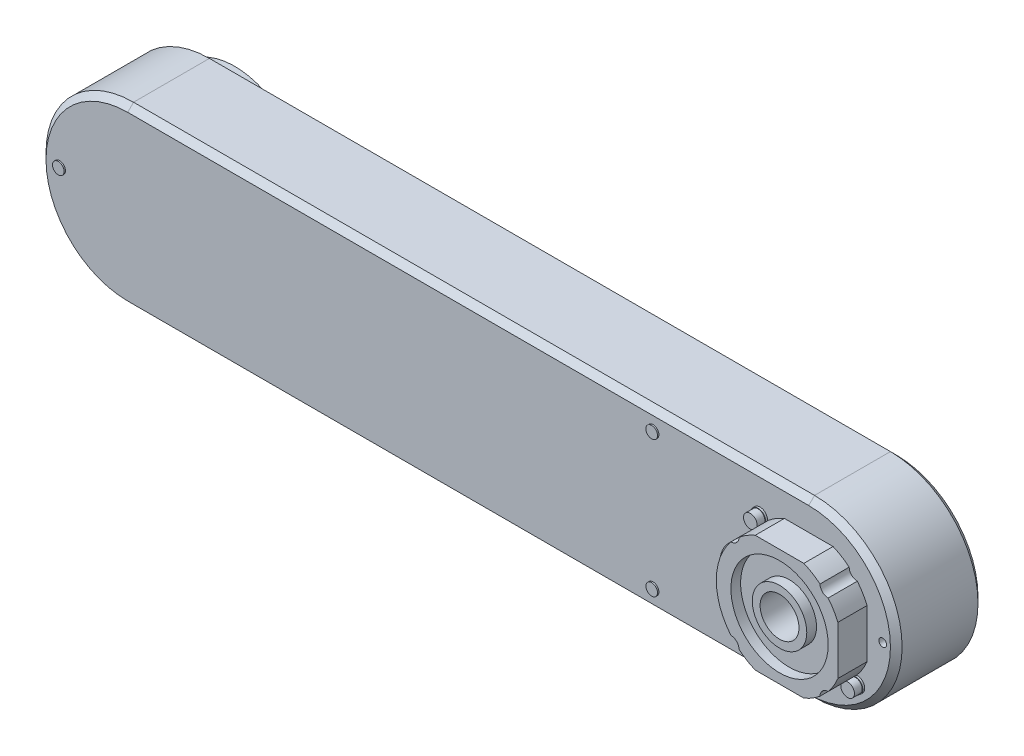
ISO-10303-21;
HEADER;
FILE_DESCRIPTION(('STEP AP214'),'2;1');
FILE_NAME('part.step','',(''),(''),'','','');
FILE_SCHEMA(('AUTOMOTIVE_DESIGN { 1 0 10303 214 1 1 1 1 }'));
ENDSEC;
DATA;
#1=APPLICATION_CONTEXT('core data for automotive mechanical design processes');
#2=APPLICATION_PROTOCOL_DEFINITION('international standard','automotive_design',2000,#1);
#3=PRODUCT_CONTEXT('',#1,'mechanical');
#4=PRODUCT('Part','Part','',(#3));
#5=PRODUCT_RELATED_PRODUCT_CATEGORY('part','',(#4));
#6=PRODUCT_DEFINITION_FORMATION('','',#4);
#7=PRODUCT_DEFINITION_CONTEXT('part definition',#1,'design');
#8=PRODUCT_DEFINITION('design','',#6,#7);
#9=PRODUCT_DEFINITION_SHAPE('','',#8);
#10=(LENGTH_UNIT() NAMED_UNIT(*) SI_UNIT(.MILLI.,.METRE.));
#11=(NAMED_UNIT(*) PLANE_ANGLE_UNIT() SI_UNIT($,.RADIAN.));
#12=(NAMED_UNIT(*) SI_UNIT($,.STERADIAN.) SOLID_ANGLE_UNIT());
#13=UNCERTAINTY_MEASURE_WITH_UNIT(LENGTH_MEASURE(1.E-05),#10,'distance_accuracy_value','');
#14=(GEOMETRIC_REPRESENTATION_CONTEXT(3) GLOBAL_UNCERTAINTY_ASSIGNED_CONTEXT((#13)) GLOBAL_UNIT_ASSIGNED_CONTEXT((#10,
#11,#12)) REPRESENTATION_CONTEXT('',''));
#15=CARTESIAN_POINT('',(0.,0.,0.));
#16=DIRECTION('',(0.,0.,1.));
#17=DIRECTION('',(1.,0.,0.));
#18=AXIS2_PLACEMENT_3D('',#15,#16,#17);
#19=CARTESIAN_POINT('',(350.,0.,45.));
#20=DIRECTION('',(0.,0.,1.));
#21=DIRECTION('',(1.,0.,0.));
#22=AXIS2_PLACEMENT_3D('',#19,#20,#21);
#23=PLANE('',#22);
#24=CARTESIAN_POINT('',(350.,0.,45.));
#25=DIRECTION('',(0.,0.,1.));
#26=DIRECTION('',(1.,0.,0.));
#27=AXIS2_PLACEMENT_3D('',#24,#25,#26);
#28=CIRCLE('',#27,10.);
#29=CARTESIAN_POINT('',(360.,0.,45.));
#30=VERTEX_POINT('',#29);
#31=EDGE_CURVE('E20',#30,#30,#28,.T.);
#32=ORIENTED_EDGE('',*,*,#31,.T.);
#33=EDGE_LOOP('',(#32));
#34=FACE_BOUND('',#33,.T.);
#35=ADVANCED_FACE('F17',(#34),#23,.T.);
#36=CARTESIAN_POINT('',(350.,0.,45.));
#37=DIRECTION('',(0.,0.,1.));
#38=DIRECTION('',(1.,0.,0.));
#39=AXIS2_PLACEMENT_3D('',#36,#37,#38);
#40=CYLINDRICAL_SURFACE('',#39,10.);
#41=CARTESIAN_POINT('',(350.,0.,60.));
#42=DIRECTION('',(0.,0.,1.));
#43=DIRECTION('',(1.,0.,0.));
#44=AXIS2_PLACEMENT_3D('',#41,#42,#43);
#45=CIRCLE('',#44,10.);
#46=CARTESIAN_POINT('',(360.,0.,60.));
#47=VERTEX_POINT('',#46);
#48=EDGE_CURVE('E232',#47,#47,#45,.F.);
#49=ORIENTED_EDGE('',*,*,#48,.F.);
#50=EDGE_LOOP('',(#49));
#51=FACE_BOUND('',#50,.T.);
#52=ORIENTED_EDGE('',*,*,#31,.F.);
#53=EDGE_LOOP('',(#52));
#54=FACE_BOUND('',#53,.T.);
#55=ADVANCED_FACE('F240',(#51,#54),#40,.F.);
#56=CARTESIAN_POINT('',(375.,25.,60.));
#57=DIRECTION('',(0.,0.,1.));
#58=DIRECTION('',(1.,0.,0.));
#59=AXIS2_PLACEMENT_3D('',#56,#57,#58);
#60=PLANE('',#59);
#61=CARTESIAN_POINT('',(350.,0.,60.));
#62=DIRECTION('',(0.,0.,1.));
#63=DIRECTION('',(1.,0.,0.));
#64=AXIS2_PLACEMENT_3D('',#61,#62,#63);
#65=CIRCLE('',#64,14.);
#66=CARTESIAN_POINT('',(364.,0.,60.));
#67=VERTEX_POINT('',#66);
#68=EDGE_CURVE('E230',#67,#67,#65,.F.);
#69=ORIENTED_EDGE('',*,*,#68,.F.);
#70=EDGE_LOOP('',(#69));
#71=FACE_BOUND('',#70,.T.);
#72=ORIENTED_EDGE('',*,*,#48,.T.);
#73=EDGE_LOOP('',(#72));
#74=FACE_BOUND('',#73,.T.);
#75=ADVANCED_FACE('F242',(#71,#74),#60,.T.);
#76=CARTESIAN_POINT('',(325.,25.,50.));
#77=DIRECTION('',(0.,0.,1.));
#78=DIRECTION('',(1.,0.,0.));
#79=AXIS2_PLACEMENT_3D('',#76,#77,#78);
#80=PLANE('',#79);
#81=CARTESIAN_POINT('',(325.,25.,50.));
#82=DIRECTION('',(0.,0.,-1.));
#83=DIRECTION('',(-1.,0.,0.));
#84=AXIS2_PLACEMENT_3D('',#81,#82,#83);
#85=CIRCLE('',#84,3.5);
#86=CARTESIAN_POINT('',(321.5,25.,50.));
#87=VERTEX_POINT('',#86);
#88=EDGE_CURVE('E227',#87,#87,#85,.T.);
#89=ORIENTED_EDGE('',*,*,#88,.F.);
#90=EDGE_LOOP('',(#89));
#91=FACE_BOUND('',#90,.T.);
#92=ADVANCED_FACE('F249',(#91),#80,.T.);
#93=CARTESIAN_POINT('',(375.,-25.,50.));
#94=DIRECTION('',(0.,0.,1.));
#95=DIRECTION('',(1.,0.,0.));
#96=AXIS2_PLACEMENT_3D('',#93,#94,#95);
#97=PLANE('',#96);
#98=CARTESIAN_POINT('',(375.,-25.,50.));
#99=DIRECTION('',(0.,0.,-1.));
#100=DIRECTION('',(-1.,0.,0.));
#101=AXIS2_PLACEMENT_3D('',#98,#99,#100);
#102=CIRCLE('',#101,3.5);
#103=CARTESIAN_POINT('',(371.5,-25.,50.));
#104=VERTEX_POINT('',#103);
#105=EDGE_CURVE('E224',#104,#104,#102,.T.);
#106=ORIENTED_EDGE('',*,*,#105,.F.);
#107=EDGE_LOOP('',(#106));
#108=FACE_BOUND('',#107,.T.);
#109=ADVANCED_FACE('F505',(#108),#97,.T.);
#110=CARTESIAN_POINT('',(350.,0.,55.));
#111=DIRECTION('',(0.,0.,1.));
#112=DIRECTION('',(1.,0.,0.));
#113=AXIS2_PLACEMENT_3D('',#110,#111,#112);
#114=CYLINDRICAL_SURFACE('',#113,14.);
#115=CARTESIAN_POINT('',(350.,0.,55.));
#116=DIRECTION('',(0.,0.,1.));
#117=DIRECTION('',(1.,0.,0.));
#118=AXIS2_PLACEMENT_3D('',#115,#116,#117);
#119=CIRCLE('',#118,14.);
#120=CARTESIAN_POINT('',(364.,0.,55.));
#121=VERTEX_POINT('',#120);
#122=EDGE_CURVE('E221',#121,#121,#119,.F.);
#123=ORIENTED_EDGE('',*,*,#122,.F.);
#124=EDGE_LOOP('',(#123));
#125=FACE_BOUND('',#124,.T.);
#126=ORIENTED_EDGE('',*,*,#68,.T.);
#127=EDGE_LOOP('',(#126));
#128=FACE_BOUND('',#127,.T.);
#129=ADVANCED_FACE('F501',(#125,#128),#114,.T.);
#130=CARTESIAN_POINT('',(325.,25.,50.));
#131=DIRECTION('',(0.,0.,-1.));
#132=DIRECTION('',(-1.,0.,0.));
#133=AXIS2_PLACEMENT_3D('',#130,#131,#132);
#134=CYLINDRICAL_SURFACE('',#133,3.5);
#135=CARTESIAN_POINT('',(325.,25.,46.));
#136=DIRECTION('',(0.,0.,-1.));
#137=DIRECTION('',(-1.,0.,0.));
#138=AXIS2_PLACEMENT_3D('',#135,#136,#137);
#139=CIRCLE('',#138,3.5);
#140=CARTESIAN_POINT('',(321.5,25.,46.));
#141=VERTEX_POINT('',#140);
#142=EDGE_CURVE('E218',#141,#141,#139,.T.);
#143=ORIENTED_EDGE('',*,*,#142,.F.);
#144=EDGE_LOOP('',(#143));
#145=FACE_BOUND('',#144,.T.);
#146=ORIENTED_EDGE('',*,*,#88,.T.);
#147=EDGE_LOOP('',(#146));
#148=FACE_BOUND('',#147,.T.);
#149=ADVANCED_FACE('F497',(#145,#148),#134,.T.);
#150=CARTESIAN_POINT('',(375.,-25.,50.));
#151=DIRECTION('',(0.,0.,-1.));
#152=DIRECTION('',(-1.,0.,0.));
#153=AXIS2_PLACEMENT_3D('',#150,#151,#152);
#154=CYLINDRICAL_SURFACE('',#153,3.5);
#155=CARTESIAN_POINT('',(375.,-25.,46.));
#156=DIRECTION('',(0.,0.,-1.));
#157=DIRECTION('',(-1.,0.,0.));
#158=AXIS2_PLACEMENT_3D('',#155,#156,#157);
#159=CIRCLE('',#158,3.5);
#160=CARTESIAN_POINT('',(371.5,-25.,46.));
#161=VERTEX_POINT('',#160);
#162=EDGE_CURVE('E215',#161,#161,#159,.T.);
#163=ORIENTED_EDGE('',*,*,#162,.F.);
#164=EDGE_LOOP('',(#163));
#165=FACE_BOUND('',#164,.T.);
#166=ORIENTED_EDGE('',*,*,#105,.T.);
#167=EDGE_LOOP('',(#166));
#168=FACE_BOUND('',#167,.T.);
#169=ADVANCED_FACE('F493',(#165,#168),#154,.T.);
#170=CARTESIAN_POINT('',(350.,0.,55.));
#171=DIRECTION('',(0.,0.,1.));
#172=DIRECTION('',(1.,0.,0.));
#173=AXIS2_PLACEMENT_3D('',#170,#171,#172);
#174=PLANE('',#173);
#175=CARTESIAN_POINT('',(350.,0.,55.));
#176=DIRECTION('',(0.,0.,1.));
#177=DIRECTION('',(1.,0.,0.));
#178=AXIS2_PLACEMENT_3D('',#175,#176,#177);
#179=CIRCLE('',#178,25.);
#180=CARTESIAN_POINT('',(375.,0.,55.));
#181=VERTEX_POINT('',#180);
#182=EDGE_CURVE('E212',#181,#181,#179,.T.);
#183=ORIENTED_EDGE('',*,*,#182,.T.);
#184=EDGE_LOOP('',(#183));
#185=FACE_BOUND('',#184,.T.);
#186=ORIENTED_EDGE('',*,*,#122,.T.);
#187=EDGE_LOOP('',(#186));
#188=FACE_BOUND('',#187,.T.);
#189=ADVANCED_FACE('F489',(#185,#188),#174,.T.);
#190=CARTESIAN_POINT('',(325.,25.,46.));
#191=DIRECTION('',(0.,0.,1.));
#192=DIRECTION('',(1.,0.,0.));
#193=AXIS2_PLACEMENT_3D('',#190,#191,#192);
#194=PLANE('',#193);
#195=CARTESIAN_POINT('',(325.,25.,46.));
#196=DIRECTION('',(0.,0.,-1.));
#197=DIRECTION('',(-1.,0.,0.));
#198=AXIS2_PLACEMENT_3D('',#195,#196,#197);
#199=CIRCLE('',#198,3.80000000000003);
#200=CARTESIAN_POINT('',(321.2,25.,46.));
#201=VERTEX_POINT('',#200);
#202=EDGE_CURVE('E208',#201,#201,#199,.T.);
#203=ORIENTED_EDGE('',*,*,#202,.F.);
#204=EDGE_LOOP('',(#203));
#205=FACE_BOUND('',#204,.T.);
#206=ORIENTED_EDGE('',*,*,#142,.T.);
#207=EDGE_LOOP('',(#206));
#208=FACE_BOUND('',#207,.T.);
#209=ADVANCED_FACE('F485',(#205,#208),#194,.T.);
#210=CARTESIAN_POINT('',(375.,-25.,46.));
#211=DIRECTION('',(0.,0.,1.));
#212=DIRECTION('',(1.,0.,0.));
#213=AXIS2_PLACEMENT_3D('',#210,#211,#212);
#214=PLANE('',#213);
#215=CARTESIAN_POINT('',(375.,-25.,46.));
#216=DIRECTION('',(0.,0.,-1.));
#217=DIRECTION('',(-1.,0.,0.));
#218=AXIS2_PLACEMENT_3D('',#215,#216,#217);
#219=CIRCLE('',#218,3.80000000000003);
#220=CARTESIAN_POINT('',(371.2,-25.,46.));
#221=VERTEX_POINT('',#220);
#222=EDGE_CURVE('E205',#221,#221,#219,.T.);
#223=ORIENTED_EDGE('',*,*,#222,.F.);
#224=EDGE_LOOP('',(#223));
#225=FACE_BOUND('',#224,.T.);
#226=ORIENTED_EDGE('',*,*,#162,.T.);
#227=EDGE_LOOP('',(#226));
#228=FACE_BOUND('',#227,.T.);
#229=ADVANCED_FACE('F481',(#225,#228),#214,.T.);
#230=CARTESIAN_POINT('',(350.,0.,55.));
#231=DIRECTION('',(0.,0.,1.));
#232=DIRECTION('',(1.,0.,0.));
#233=AXIS2_PLACEMENT_3D('',#230,#231,#232);
#234=CYLINDRICAL_SURFACE('',#233,25.);
#235=CARTESIAN_POINT('',(350.,0.,60.));
#236=DIRECTION('',(0.,0.,1.));
#237=DIRECTION('',(1.,0.,0.));
#238=AXIS2_PLACEMENT_3D('',#235,#236,#237);
#239=CIRCLE('',#238,25.);
#240=CARTESIAN_POINT('',(375.,0.,60.));
#241=VERTEX_POINT('',#240);
#242=EDGE_CURVE('E190',#241,#241,#239,.F.);
#243=ORIENTED_EDGE('',*,*,#242,.F.);
#244=EDGE_LOOP('',(#243));
#245=FACE_BOUND('',#244,.T.);
#246=ORIENTED_EDGE('',*,*,#182,.F.);
#247=EDGE_LOOP('',(#246));
#248=FACE_BOUND('',#247,.T.);
#249=ADVANCED_FACE('F477',(#245,#248),#234,.F.);
#250=CARTESIAN_POINT('',(326.8,0.,51.5));
#251=DIRECTION('',(0.,0.,1.));
#252=DIRECTION('',(1.,0.,0.));
#253=AXIS2_PLACEMENT_3D('',#250,#251,#252);
#254=PLANE('',#253);
#255=CARTESIAN_POINT('',(326.8,0.,51.5));
#256=DIRECTION('',(0.,0.,-1.));
#257=DIRECTION('',(-1.,0.,0.));
#258=AXIS2_PLACEMENT_3D('',#255,#256,#257);
#259=CIRCLE('',#258,16.);
#260=CARTESIAN_POINT('',(320.,-14.4830935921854,51.5));
#261=VERTEX_POINT('',#260);
#262=CARTESIAN_POINT('',(320.,14.4830935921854,51.5));
#263=VERTEX_POINT('',#262);
#264=EDGE_CURVE('E950',#261,#263,#259,.T.);
#265=ORIENTED_EDGE('',*,*,#264,.F.);
#266=DIRECTION('',(0.,1.,0.));
#267=VECTOR('',#266,1.);
#268=CARTESIAN_POINT('',(320.,14.4830935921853,51.5));
#269=LINE('',#268,#267);
#270=CARTESIAN_POINT('',(320.,-12.4999999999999,51.5));
#271=VERTEX_POINT('',#270);
#272=EDGE_CURVE('E953',#261,#271,#269,.T.);
#273=ORIENTED_EDGE('',*,*,#272,.T.);
#274=CARTESIAN_POINT('',(350.,0.,51.5));
#275=DIRECTION('',(0.,0.,-1.));
#276=DIRECTION('',(-1.,0.,0.));
#277=AXIS2_PLACEMENT_3D('',#274,#275,#276);
#278=CIRCLE('',#277,32.5);
#279=CARTESIAN_POINT('',(320.,12.4999999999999,51.5));
#280=VERTEX_POINT('',#279);
#281=EDGE_CURVE('E980',#280,#271,#278,.F.);
#282=ORIENTED_EDGE('',*,*,#281,.F.);
#283=DIRECTION('',(0.,1.,0.));
#284=VECTOR('',#283,1.);
#285=CARTESIAN_POINT('',(320.,14.4830935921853,51.5));
#286=LINE('',#285,#284);
#287=EDGE_CURVE('E211',#280,#263,#286,.T.);
#288=ORIENTED_EDGE('',*,*,#287,.T.);
#289=EDGE_LOOP('',(#265,#273,#282,#288));
#290=FACE_BOUND('',#289,.T.);
#291=ADVANCED_FACE('F473',(#290),#254,.T.);
#292=CARTESIAN_POINT('',(388.,0.,40.));
#293=DIRECTION('',(0.,0.,1.));
#294=DIRECTION('',(1.,0.,0.));
#295=AXIS2_PLACEMENT_3D('',#292,#293,#294);
#296=PLANE('',#295);
#297=CARTESIAN_POINT('',(388.,0.,40.));
#298=DIRECTION('',(0.,0.,1.));
#299=DIRECTION('',(1.,0.,0.));
#300=AXIS2_PLACEMENT_3D('',#297,#298,#299);
#301=CIRCLE('',#300,2.);
#302=CARTESIAN_POINT('',(390.,0.,40.));
#303=VERTEX_POINT('',#302);
#304=EDGE_CURVE('E1118',#303,#303,#301,.T.);
#305=ORIENTED_EDGE('',*,*,#304,.T.);
#306=EDGE_LOOP('',(#305));
#307=FACE_BOUND('',#306,.T.);
#308=ADVANCED_FACE('F469',(#307),#296,.T.);
#309=CARTESIAN_POINT('',(-35.,0.,45.7));
#310=DIRECTION('',(0.,0.,1.));
#311=DIRECTION('',(1.,0.,0.));
#312=AXIS2_PLACEMENT_3D('',#309,#310,#311);
#313=PLANE('',#312);
#314=CARTESIAN_POINT('',(-35.,0.,45.7));
#315=DIRECTION('',(0.,0.,-1.));
#316=DIRECTION('',(-1.,0.,0.));
#317=AXIS2_PLACEMENT_3D('',#314,#315,#316);
#318=CIRCLE('',#317,3.);
#319=CARTESIAN_POINT('',(-38.,0.,45.7));
#320=VERTEX_POINT('',#319);
#321=EDGE_CURVE('E1115',#320,#320,#318,.T.);
#322=ORIENTED_EDGE('',*,*,#321,.F.);
#323=EDGE_LOOP('',(#322));
#324=FACE_BOUND('',#323,.T.);
#325=ADVANCED_FACE('F465',(#324),#313,.T.);
#326=CARTESIAN_POINT('',(270.,35.,45.7));
#327=DIRECTION('',(0.,0.,1.));
#328=DIRECTION('',(1.,0.,0.));
#329=AXIS2_PLACEMENT_3D('',#326,#327,#328);
#330=PLANE('',#329);
#331=CARTESIAN_POINT('',(270.,35.,45.7));
#332=DIRECTION('',(0.,0.,-1.));
#333=DIRECTION('',(-1.,0.,0.));
#334=AXIS2_PLACEMENT_3D('',#331,#332,#333);
#335=CIRCLE('',#334,3.);
#336=CARTESIAN_POINT('',(267.,35.,45.7));
#337=VERTEX_POINT('',#336);
#338=EDGE_CURVE('E1112',#337,#337,#335,.T.);
#339=ORIENTED_EDGE('',*,*,#338,.F.);
#340=EDGE_LOOP('',(#339));
#341=FACE_BOUND('',#340,.T.);
#342=ADVANCED_FACE('F461',(#341),#330,.T.);
#343=CARTESIAN_POINT('',(270.,-35.,45.7));
#344=DIRECTION('',(0.,0.,1.));
#345=DIRECTION('',(1.,0.,0.));
#346=AXIS2_PLACEMENT_3D('',#343,#344,#345);
#347=PLANE('',#346);
#348=CARTESIAN_POINT('',(270.,-35.,45.7));
#349=DIRECTION('',(0.,0.,-1.));
#350=DIRECTION('',(-1.,0.,0.));
#351=AXIS2_PLACEMENT_3D('',#348,#349,#350);
#352=CIRCLE('',#351,3.);
#353=CARTESIAN_POINT('',(267.,-35.,45.7));
#354=VERTEX_POINT('',#353);
#355=EDGE_CURVE('E1109',#354,#354,#352,.T.);
#356=ORIENTED_EDGE('',*,*,#355,.F.);
#357=EDGE_LOOP('',(#356));
#358=FACE_BOUND('',#357,.T.);
#359=ADVANCED_FACE('F457',(#358),#347,.T.);
#360=CARTESIAN_POINT('',(325.,25.,46.));
#361=DIRECTION('',(0.,0.,-1.));
#362=DIRECTION('',(-1.,0.,0.));
#363=AXIS2_PLACEMENT_3D('',#360,#361,#362);
#364=CYLINDRICAL_SURFACE('',#363,3.80000000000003);
#365=CARTESIAN_POINT('',(325.,25.,45.));
#366=DIRECTION('',(0.,0.,-1.));
#367=DIRECTION('',(-1.,0.,0.));
#368=AXIS2_PLACEMENT_3D('',#365,#366,#367);
#369=CIRCLE('',#368,3.80000000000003);
#370=CARTESIAN_POINT('',(321.2,25.,45.));
#371=VERTEX_POINT('',#370);
#372=EDGE_CURVE('E1106',#371,#371,#369,.T.);
#373=ORIENTED_EDGE('',*,*,#372,.F.);
#374=EDGE_LOOP('',(#373));
#375=FACE_BOUND('',#374,.T.);
#376=ORIENTED_EDGE('',*,*,#202,.T.);
#377=EDGE_LOOP('',(#376));
#378=FACE_BOUND('',#377,.T.);
#379=ADVANCED_FACE('F453',(#375,#378),#364,.T.);
#380=CARTESIAN_POINT('',(325.,25.,60.));
#381=DIRECTION('',(0.,0.,-1.));
#382=DIRECTION('',(-1.,0.,0.));
#383=AXIS2_PLACEMENT_3D('',#380,#381,#382);
#384=CYLINDRICAL_SURFACE('',#383,4.19999999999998);
#385=DIRECTION('',(0.,0.,-1.));
#386=VECTOR('',#385,1.);
#387=CARTESIAN_POINT('',(325.02789261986,20.8000926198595,60.));
#388=LINE('',#387,#386);
#389=CARTESIAN_POINT('',(325.02789261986,20.8000926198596,60.));
#390=VERTEX_POINT('',#389);
#391=CARTESIAN_POINT('',(325.02789261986,20.8000926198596,45.));
#392=VERTEX_POINT('',#391);
#393=EDGE_CURVE('E998',#390,#392,#388,.T.);
#394=ORIENTED_EDGE('',*,*,#393,.F.);
#395=CARTESIAN_POINT('',(325.,25.,60.));
#396=DIRECTION('',(0.,0.,-1.));
#397=DIRECTION('',(-1.,0.,0.));
#398=AXIS2_PLACEMENT_3D('',#395,#396,#397);
#399=CIRCLE('',#398,4.19999999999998);
#400=CARTESIAN_POINT('',(329.19990738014,24.9721073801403,60.));
#401=VERTEX_POINT('',#400);
#402=EDGE_CURVE('E198',#401,#390,#399,.T.);
#403=ORIENTED_EDGE('',*,*,#402,.F.);
#404=DIRECTION('',(0.,0.,-1.));
#405=VECTOR('',#404,1.);
#406=CARTESIAN_POINT('',(329.19990738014,24.9721073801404,60.));
#407=LINE('',#406,#405);
#408=CARTESIAN_POINT('',(329.19990738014,24.9721073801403,45.));
#409=VERTEX_POINT('',#408);
#410=EDGE_CURVE('E179',#409,#401,#407,.F.);
#411=ORIENTED_EDGE('',*,*,#410,.F.);
#412=CARTESIAN_POINT('',(325.,25.,45.));
#413=DIRECTION('',(0.,0.,-1.));
#414=DIRECTION('',(-1.,0.,0.));
#415=AXIS2_PLACEMENT_3D('',#412,#413,#414);
#416=CIRCLE('',#415,4.19999999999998);
#417=EDGE_CURVE('E1104',#392,#409,#416,.F.);
#418=ORIENTED_EDGE('',*,*,#417,.F.);
#419=EDGE_LOOP('',(#394,#403,#411,#418));
#420=FACE_BOUND('',#419,.T.);
#421=ADVANCED_FACE('F449',(#420),#384,.F.);
#422=CARTESIAN_POINT('',(320.,14.4830935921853,51.5));
#423=DIRECTION('',(-1.,0.,0.));
#424=DIRECTION('',(0.,0.,1.));
#425=AXIS2_PLACEMENT_3D('',#422,#423,#424);
#426=PLANE('',#425);
#427=DIRECTION('',(0.,1.,0.));
#428=VECTOR('',#427,1.);
#429=CARTESIAN_POINT('',(320.,0.,45.));
#430=LINE('',#429,#428);
#431=CARTESIAN_POINT('',(320.,14.4830935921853,45.));
#432=VERTEX_POINT('',#431);
#433=CARTESIAN_POINT('',(320.,12.4999999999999,45.));
#434=VERTEX_POINT('',#433);
#435=EDGE_CURVE('E1101',#432,#434,#430,.F.);
#436=ORIENTED_EDGE('',*,*,#435,.F.);
#437=DIRECTION('',(0.,0.,-1.));
#438=VECTOR('',#437,1.);
#439=CARTESIAN_POINT('',(320.,14.4830935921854,51.5));
#440=LINE('',#439,#438);
#441=EDGE_CURVE('E957',#263,#432,#440,.T.);
#442=ORIENTED_EDGE('',*,*,#441,.F.);
#443=ORIENTED_EDGE('',*,*,#287,.F.);
#444=DIRECTION('',(0.,0.,-1.));
#445=VECTOR('',#444,1.);
#446=CARTESIAN_POINT('',(320.,12.5,60.));
#447=LINE('',#446,#445);
#448=EDGE_CURVE('E1000',#434,#280,#447,.F.);
#449=ORIENTED_EDGE('',*,*,#448,.F.);
#450=EDGE_LOOP('',(#436,#442,#443,#449));
#451=FACE_BOUND('',#450,.T.);
#452=ADVANCED_FACE('F445',(#451),#426,.F.);
#453=CARTESIAN_POINT('',(350.,0.,60.));
#454=DIRECTION('',(0.,0.,-1.));
#455=DIRECTION('',(-1.,0.,0.));
#456=AXIS2_PLACEMENT_3D('',#453,#454,#455);
#457=CYLINDRICAL_SURFACE('',#456,32.5);
#458=CARTESIAN_POINT('',(350.,0.,60.));
#459=DIRECTION('',(0.,0.,-1.));
#460=DIRECTION('',(-1.,0.,0.));
#461=AXIS2_PLACEMENT_3D('',#458,#459,#460);
#462=CIRCLE('',#461,32.5);
#463=CARTESIAN_POINT('',(337.5,30.,60.));
#464=VERTEX_POINT('',#463);
#465=EDGE_CURVE('E195',#464,#401,#462,.F.);
#466=ORIENTED_EDGE('',*,*,#465,.F.);
#467=DIRECTION('',(0.,0.,1.));
#468=VECTOR('',#467,1.);
#469=CARTESIAN_POINT('',(337.5,30.,60.));
#470=LINE('',#469,#468);
#471=CARTESIAN_POINT('',(337.5,30.,45.));
#472=VERTEX_POINT('',#471);
#473=EDGE_CURVE('E997',#464,#472,#470,.F.);
#474=ORIENTED_EDGE('',*,*,#473,.T.);
#475=CARTESIAN_POINT('',(350.,0.,45.));
#476=DIRECTION('',(0.,0.,-1.));
#477=DIRECTION('',(-1.,0.,0.));
#478=AXIS2_PLACEMENT_3D('',#475,#476,#477);
#479=CIRCLE('',#478,32.5);
#480=EDGE_CURVE('E1102',#409,#472,#479,.T.);
#481=ORIENTED_EDGE('',*,*,#480,.F.);
#482=ORIENTED_EDGE('',*,*,#410,.T.);
#483=EDGE_LOOP('',(#466,#474,#481,#482));
#484=FACE_BOUND('',#483,.T.);
#485=ADVANCED_FACE('F442',(#484),#457,.T.);
#486=CARTESIAN_POINT('',(350.,0.,60.));
#487=DIRECTION('',(0.,0.,-1.));
#488=DIRECTION('',(-1.,0.,0.));
#489=AXIS2_PLACEMENT_3D('',#486,#487,#488);
#490=CYLINDRICAL_SURFACE('',#489,32.5);
#491=CARTESIAN_POINT('',(350.,0.,60.));
#492=DIRECTION('',(0.,0.,-1.));
#493=DIRECTION('',(-1.,0.,0.));
#494=AXIS2_PLACEMENT_3D('',#491,#492,#493);
#495=CIRCLE('',#494,32.5);
#496=CARTESIAN_POINT('',(370.80009261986,24.9721073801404,60.));
#497=VERTEX_POINT('',#496);
#498=CARTESIAN_POINT('',(362.5,30.,60.));
#499=VERTEX_POINT('',#498);
#500=EDGE_CURVE('E187',#497,#499,#495,.F.);
#501=ORIENTED_EDGE('',*,*,#500,.F.);
#502=DIRECTION('',(0.,0.,-1.));
#503=VECTOR('',#502,1.);
#504=CARTESIAN_POINT('',(370.80009261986,24.9721073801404,60.));
#505=LINE('',#504,#503);
#506=CARTESIAN_POINT('',(370.80009261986,24.9721073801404,45.));
#507=VERTEX_POINT('',#506);
#508=EDGE_CURVE('E169',#497,#507,#505,.T.);
#509=ORIENTED_EDGE('',*,*,#508,.T.);
#510=CARTESIAN_POINT('',(350.,0.,45.));
#511=DIRECTION('',(0.,0.,-1.));
#512=DIRECTION('',(-1.,0.,0.));
#513=AXIS2_PLACEMENT_3D('',#510,#511,#512);
#514=CIRCLE('',#513,32.5);
#515=CARTESIAN_POINT('',(362.5,30.,45.));
#516=VERTEX_POINT('',#515);
#517=EDGE_CURVE('E1096',#516,#507,#514,.T.);
#518=ORIENTED_EDGE('',*,*,#517,.F.);
#519=DIRECTION('',(0.,0.,1.));
#520=VECTOR('',#519,1.);
#521=CARTESIAN_POINT('',(362.5,30.,60.));
#522=LINE('',#521,#520);
#523=EDGE_CURVE('E194',#516,#499,#522,.T.);
#524=ORIENTED_EDGE('',*,*,#523,.T.);
#525=EDGE_LOOP('',(#501,#509,#518,#524));
#526=FACE_BOUND('',#525,.T.);
#527=ADVANCED_FACE('F193',(#526),#490,.T.);
#528=CARTESIAN_POINT('',(375.,25.,60.));
#529=DIRECTION('',(0.,0.,-1.));
#530=DIRECTION('',(-1.,0.,0.));
#531=AXIS2_PLACEMENT_3D('',#528,#529,#530);
#532=CYLINDRICAL_SURFACE('',#531,4.19999999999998);
#533=ORIENTED_EDGE('',*,*,#508,.F.);
#534=CARTESIAN_POINT('',(375.,25.,60.));
#535=DIRECTION('',(0.,0.,-1.));
#536=DIRECTION('',(-1.,0.,0.));
#537=AXIS2_PLACEMENT_3D('',#534,#535,#536);
#538=CIRCLE('',#537,4.19999999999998);
#539=CARTESIAN_POINT('',(374.97210738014,20.8000926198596,60.));
#540=VERTEX_POINT('',#539);
#541=EDGE_CURVE('E173',#540,#497,#538,.T.);
#542=ORIENTED_EDGE('',*,*,#541,.F.);
#543=DIRECTION('',(0.,0.,-1.));
#544=VECTOR('',#543,1.);
#545=CARTESIAN_POINT('',(374.97210738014,20.8000926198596,60.));
#546=LINE('',#545,#544);
#547=CARTESIAN_POINT('',(374.97210738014,20.8000926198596,45.));
#548=VERTEX_POINT('',#547);
#549=EDGE_CURVE('E178',#548,#540,#546,.F.);
#550=ORIENTED_EDGE('',*,*,#549,.F.);
#551=CARTESIAN_POINT('',(375.,25.,45.));
#552=DIRECTION('',(0.,0.,-1.));
#553=DIRECTION('',(-1.,0.,0.));
#554=AXIS2_PLACEMENT_3D('',#551,#552,#553);
#555=CIRCLE('',#554,4.19999999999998);
#556=EDGE_CURVE('E174',#507,#548,#555,.F.);
#557=ORIENTED_EDGE('',*,*,#556,.F.);
#558=EDGE_LOOP('',(#533,#542,#550,#557));
#559=FACE_BOUND('',#558,.T.);
#560=ADVANCED_FACE('F171',(#559),#532,.F.);
#561=CARTESIAN_POINT('',(350.,0.,60.));
#562=DIRECTION('',(0.,0.,-1.));
#563=DIRECTION('',(-1.,0.,0.));
#564=AXIS2_PLACEMENT_3D('',#561,#562,#563);
#565=CYLINDRICAL_SURFACE('',#564,32.5);
#566=CARTESIAN_POINT('',(350.,0.,60.));
#567=DIRECTION('',(0.,0.,-1.));
#568=DIRECTION('',(-1.,0.,0.));
#569=AXIS2_PLACEMENT_3D('',#566,#567,#568);
#570=CIRCLE('',#569,32.5);
#571=CARTESIAN_POINT('',(380.,12.4999999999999,60.));
#572=VERTEX_POINT('',#571);
#573=EDGE_CURVE('E189',#572,#540,#570,.F.);
#574=ORIENTED_EDGE('',*,*,#573,.F.);
#575=DIRECTION('',(0.,0.,1.));
#576=VECTOR('',#575,1.);
#577=CARTESIAN_POINT('',(380.,12.4999999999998,60.));
#578=LINE('',#577,#576);
#579=CARTESIAN_POINT('',(380.,12.4999999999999,45.));
#580=VERTEX_POINT('',#579);
#581=EDGE_CURVE('E992',#572,#580,#578,.F.);
#582=ORIENTED_EDGE('',*,*,#581,.T.);
#583=CARTESIAN_POINT('',(350.,0.,45.));
#584=DIRECTION('',(0.,0.,-1.));
#585=DIRECTION('',(-1.,0.,0.));
#586=AXIS2_PLACEMENT_3D('',#583,#584,#585);
#587=CIRCLE('',#586,32.5);
#588=EDGE_CURVE('E1093',#548,#580,#587,.T.);
#589=ORIENTED_EDGE('',*,*,#588,.F.);
#590=ORIENTED_EDGE('',*,*,#549,.T.);
#591=EDGE_LOOP('',(#574,#582,#589,#590));
#592=FACE_BOUND('',#591,.T.);
#593=ADVANCED_FACE('F433',(#592),#565,.T.);
#594=CARTESIAN_POINT('',(375.,-25.,46.));
#595=DIRECTION('',(0.,0.,-1.));
#596=DIRECTION('',(-1.,0.,0.));
#597=AXIS2_PLACEMENT_3D('',#594,#595,#596);
#598=CYLINDRICAL_SURFACE('',#597,3.80000000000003);
#599=CARTESIAN_POINT('',(375.,-25.,45.));
#600=DIRECTION('',(0.,0.,-1.));
#601=DIRECTION('',(-1.,0.,0.));
#602=AXIS2_PLACEMENT_3D('',#599,#600,#601);
#603=CIRCLE('',#602,3.80000000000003);
#604=CARTESIAN_POINT('',(371.2,-25.,45.));
#605=VERTEX_POINT('',#604);
#606=EDGE_CURVE('E1090',#605,#605,#603,.T.);
#607=ORIENTED_EDGE('',*,*,#606,.F.);
#608=EDGE_LOOP('',(#607));
#609=FACE_BOUND('',#608,.T.);
#610=ORIENTED_EDGE('',*,*,#222,.T.);
#611=EDGE_LOOP('',(#610));
#612=FACE_BOUND('',#611,.T.);
#613=ADVANCED_FACE('F429',(#609,#612),#598,.T.);
#614=CARTESIAN_POINT('',(375.,-25.,60.));
#615=DIRECTION('',(0.,0.,-1.));
#616=DIRECTION('',(-1.,0.,0.));
#617=AXIS2_PLACEMENT_3D('',#614,#615,#616);
#618=CYLINDRICAL_SURFACE('',#617,4.19999999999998);
#619=DIRECTION('',(0.,0.,-1.));
#620=VECTOR('',#619,1.);
#621=CARTESIAN_POINT('',(374.97210738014,-20.8000926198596,60.));
#622=LINE('',#621,#620);
#623=CARTESIAN_POINT('',(374.97210738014,-20.8000926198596,60.));
#624=VERTEX_POINT('',#623);
#625=CARTESIAN_POINT('',(374.97210738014,-20.8000926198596,45.));
#626=VERTEX_POINT('',#625);
#627=EDGE_CURVE('E204',#624,#626,#622,.T.);
#628=ORIENTED_EDGE('',*,*,#627,.F.);
#629=CARTESIAN_POINT('',(375.,-25.,60.));
#630=DIRECTION('',(0.,0.,-1.));
#631=DIRECTION('',(-1.,0.,0.));
#632=AXIS2_PLACEMENT_3D('',#629,#630,#631);
#633=CIRCLE('',#632,4.19999999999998);
#634=CARTESIAN_POINT('',(370.80009261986,-24.9721073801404,60.));
#635=VERTEX_POINT('',#634);
#636=EDGE_CURVE('E1132',#635,#624,#633,.T.);
#637=ORIENTED_EDGE('',*,*,#636,.F.);
#638=DIRECTION('',(0.,0.,-1.));
#639=VECTOR('',#638,1.);
#640=CARTESIAN_POINT('',(370.80009261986,-24.9721073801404,60.));
#641=LINE('',#640,#639);
#642=CARTESIAN_POINT('',(370.80009261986,-24.9721073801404,45.));
#643=VERTEX_POINT('',#642);
#644=EDGE_CURVE('E987',#643,#635,#641,.F.);
#645=ORIENTED_EDGE('',*,*,#644,.F.);
#646=CARTESIAN_POINT('',(375.,-25.,45.));
#647=DIRECTION('',(0.,0.,-1.));
#648=DIRECTION('',(-1.,0.,0.));
#649=AXIS2_PLACEMENT_3D('',#646,#647,#648);
#650=CIRCLE('',#649,4.19999999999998);
#651=EDGE_CURVE('E1088',#626,#643,#650,.F.);
#652=ORIENTED_EDGE('',*,*,#651,.F.);
#653=EDGE_LOOP('',(#628,#637,#645,#652));
#654=FACE_BOUND('',#653,.T.);
#655=ADVANCED_FACE('F425',(#654),#618,.F.);
#656=CARTESIAN_POINT('',(350.,0.,60.));
#657=DIRECTION('',(0.,0.,-1.));
#658=DIRECTION('',(-1.,0.,0.));
#659=AXIS2_PLACEMENT_3D('',#656,#657,#658);
#660=CYLINDRICAL_SURFACE('',#659,32.5);
#661=CARTESIAN_POINT('',(350.,0.,60.));
#662=DIRECTION('',(0.,0.,-1.));
#663=DIRECTION('',(-1.,0.,0.));
#664=AXIS2_PLACEMENT_3D('',#661,#662,#663);
#665=CIRCLE('',#664,32.5);
#666=CARTESIAN_POINT('',(380.,-12.4999999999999,60.));
#667=VERTEX_POINT('',#666);
#668=EDGE_CURVE('E1130',#624,#667,#665,.F.);
#669=ORIENTED_EDGE('',*,*,#668,.F.);
#670=ORIENTED_EDGE('',*,*,#627,.T.);
#671=CARTESIAN_POINT('',(350.,0.,45.));
#672=DIRECTION('',(0.,0.,-1.));
#673=DIRECTION('',(-1.,0.,0.));
#674=AXIS2_PLACEMENT_3D('',#671,#672,#673);
#675=CIRCLE('',#674,32.5);
#676=CARTESIAN_POINT('',(380.,-12.4999999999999,45.));
#677=VERTEX_POINT('',#676);
#678=EDGE_CURVE('E1083',#677,#626,#675,.T.);
#679=ORIENTED_EDGE('',*,*,#678,.F.);
#680=DIRECTION('',(0.,0.,1.));
#681=VECTOR('',#680,1.);
#682=CARTESIAN_POINT('',(380.,-12.4999999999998,60.));
#683=LINE('',#682,#681);
#684=EDGE_CURVE('E993',#677,#667,#683,.T.);
#685=ORIENTED_EDGE('',*,*,#684,.T.);
#686=EDGE_LOOP('',(#669,#670,#679,#685));
#687=FACE_BOUND('',#686,.T.);
#688=ADVANCED_FACE('F422',(#687),#660,.T.);
#689=CARTESIAN_POINT('',(375.,25.,60.));
#690=DIRECTION('',(0.,0.,1.));
#691=DIRECTION('',(1.,0.,0.));
#692=AXIS2_PLACEMENT_3D('',#689,#690,#691);
#693=PLANE('',#692);
#694=DIRECTION('',(0.,1.,0.));
#695=VECTOR('',#694,1.);
#696=CARTESIAN_POINT('',(380.,12.4999999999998,60.));
#697=LINE('',#696,#695);
#698=EDGE_CURVE('E990',#667,#572,#697,.T.);
#699=ORIENTED_EDGE('',*,*,#698,.T.);
#700=ORIENTED_EDGE('',*,*,#573,.T.);
#701=ORIENTED_EDGE('',*,*,#541,.T.);
#702=ORIENTED_EDGE('',*,*,#500,.T.);
#703=DIRECTION('',(1.,0.,0.));
#704=VECTOR('',#703,1.);
#705=CARTESIAN_POINT('',(337.5,30.,60.));
#706=LINE('',#705,#704);
#707=EDGE_CURVE('E995',#499,#464,#706,.F.);
#708=ORIENTED_EDGE('',*,*,#707,.T.);
#709=ORIENTED_EDGE('',*,*,#465,.T.);
#710=ORIENTED_EDGE('',*,*,#402,.T.);
#711=CARTESIAN_POINT('',(350.,0.,60.));
#712=DIRECTION('',(0.,0.,-1.));
#713=DIRECTION('',(-1.,0.,0.));
#714=AXIS2_PLACEMENT_3D('',#711,#712,#713);
#715=CIRCLE('',#714,32.5);
#716=CARTESIAN_POINT('',(325.02789261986,-20.8000926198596,60.));
#717=VERTEX_POINT('',#716);
#718=EDGE_CURVE('E1123',#717,#390,#715,.T.);
#719=ORIENTED_EDGE('',*,*,#718,.F.);
#720=CARTESIAN_POINT('',(325.,-25.,60.));
#721=DIRECTION('',(0.,0.,-1.));
#722=DIRECTION('',(-1.,0.,0.));
#723=AXIS2_PLACEMENT_3D('',#720,#721,#722);
#724=CIRCLE('',#723,4.19999999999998);
#725=CARTESIAN_POINT('',(329.19990738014,-24.9721073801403,60.));
#726=VERTEX_POINT('',#725);
#727=EDGE_CURVE('E1125',#717,#726,#724,.T.);
#728=ORIENTED_EDGE('',*,*,#727,.T.);
#729=CARTESIAN_POINT('',(350.,0.,60.));
#730=DIRECTION('',(0.,0.,-1.));
#731=DIRECTION('',(-1.,0.,0.));
#732=AXIS2_PLACEMENT_3D('',#729,#730,#731);
#733=CIRCLE('',#732,32.5);
#734=CARTESIAN_POINT('',(337.5,-30.,60.));
#735=VERTEX_POINT('',#734);
#736=EDGE_CURVE('E972',#735,#726,#733,.T.);
#737=ORIENTED_EDGE('',*,*,#736,.F.);
#738=DIRECTION('',(-1.,0.,0.));
#739=VECTOR('',#738,1.);
#740=CARTESIAN_POINT('',(362.5,-30.,60.));
#741=LINE('',#740,#739);
#742=CARTESIAN_POINT('',(362.5,-30.,60.));
#743=VERTEX_POINT('',#742);
#744=EDGE_CURVE('E981',#735,#743,#741,.F.);
#745=ORIENTED_EDGE('',*,*,#744,.T.);
#746=CARTESIAN_POINT('',(350.,0.,60.));
#747=DIRECTION('',(0.,0.,-1.));
#748=DIRECTION('',(-1.,0.,0.));
#749=AXIS2_PLACEMENT_3D('',#746,#747,#748);
#750=CIRCLE('',#749,32.5);
#751=EDGE_CURVE('E989',#635,#743,#750,.T.);
#752=ORIENTED_EDGE('',*,*,#751,.F.);
#753=ORIENTED_EDGE('',*,*,#636,.T.);
#754=ORIENTED_EDGE('',*,*,#668,.T.);
#755=EDGE_LOOP('',(#699,#700,#701,#702,#708,#709,#710,#719,#728,#737,#745,#752,#753,#754));
#756=FACE_BOUND('',#755,.T.);
#757=ORIENTED_EDGE('',*,*,#242,.T.);
#758=EDGE_LOOP('',(#757));
#759=FACE_BOUND('',#758,.T.);
#760=ADVANCED_FACE('F184',(#756,#759),#693,.T.);
#761=CARTESIAN_POINT('',(350.,0.,60.));
#762=DIRECTION('',(0.,0.,-1.));
#763=DIRECTION('',(-1.,0.,0.));
#764=AXIS2_PLACEMENT_3D('',#761,#762,#763);
#765=CYLINDRICAL_SURFACE('',#764,32.5);
#766=ORIENTED_EDGE('',*,*,#751,.T.);
#767=DIRECTION('',(0.,0.,1.));
#768=VECTOR('',#767,1.);
#769=CARTESIAN_POINT('',(362.5,-30.,60.));
#770=LINE('',#769,#768);
#771=CARTESIAN_POINT('',(362.5,-30.,45.));
#772=VERTEX_POINT('',#771);
#773=EDGE_CURVE('E984',#743,#772,#770,.F.);
#774=ORIENTED_EDGE('',*,*,#773,.T.);
#775=CARTESIAN_POINT('',(350.,0.,45.));
#776=DIRECTION('',(0.,0.,-1.));
#777=DIRECTION('',(-1.,0.,0.));
#778=AXIS2_PLACEMENT_3D('',#775,#776,#777);
#779=CIRCLE('',#778,32.5);
#780=EDGE_CURVE('E1086',#643,#772,#779,.T.);
#781=ORIENTED_EDGE('',*,*,#780,.F.);
#782=ORIENTED_EDGE('',*,*,#644,.T.);
#783=EDGE_LOOP('',(#766,#774,#781,#782));
#784=FACE_BOUND('',#783,.T.);
#785=ADVANCED_FACE('F415',(#784),#765,.T.);
#786=CARTESIAN_POINT('',(325.,-25.,60.));
#787=DIRECTION('',(0.,0.,-1.));
#788=DIRECTION('',(-1.,0.,0.));
#789=AXIS2_PLACEMENT_3D('',#786,#787,#788);
#790=CYLINDRICAL_SURFACE('',#789,4.19999999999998);
#791=DIRECTION('',(0.,0.,-1.));
#792=VECTOR('',#791,1.);
#793=CARTESIAN_POINT('',(329.19990738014,-24.9721073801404,60.));
#794=LINE('',#793,#792);
#795=CARTESIAN_POINT('',(329.19990738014,-24.9721073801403,45.));
#796=VERTEX_POINT('',#795);
#797=EDGE_CURVE('E970',#726,#796,#794,.T.);
#798=ORIENTED_EDGE('',*,*,#797,.F.);
#799=ORIENTED_EDGE('',*,*,#727,.F.);
#800=DIRECTION('',(0.,0.,-1.));
#801=VECTOR('',#800,1.);
#802=CARTESIAN_POINT('',(325.02789261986,-20.8000926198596,60.));
#803=LINE('',#802,#801);
#804=CARTESIAN_POINT('',(325.02789261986,-20.8000926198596,45.));
#805=VERTEX_POINT('',#804);
#806=EDGE_CURVE('E965',#805,#717,#803,.F.);
#807=ORIENTED_EDGE('',*,*,#806,.F.);
#808=CARTESIAN_POINT('',(325.,-25.,45.));
#809=DIRECTION('',(0.,0.,-1.));
#810=DIRECTION('',(-1.,0.,0.));
#811=AXIS2_PLACEMENT_3D('',#808,#809,#810);
#812=CIRCLE('',#811,4.19999999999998);
#813=EDGE_CURVE('E1081',#796,#805,#812,.F.);
#814=ORIENTED_EDGE('',*,*,#813,.F.);
#815=EDGE_LOOP('',(#798,#799,#807,#814));
#816=FACE_BOUND('',#815,.T.);
#817=ADVANCED_FACE('F411',(#816),#790,.F.);
#818=CARTESIAN_POINT('',(350.,0.,60.));
#819=DIRECTION('',(0.,0.,-1.));
#820=DIRECTION('',(-1.,0.,0.));
#821=AXIS2_PLACEMENT_3D('',#818,#819,#820);
#822=CYLINDRICAL_SURFACE('',#821,32.5);
#823=CARTESIAN_POINT('',(350.,0.,45.));
#824=DIRECTION('',(0.,0.,-1.));
#825=DIRECTION('',(-1.,0.,0.));
#826=AXIS2_PLACEMENT_3D('',#823,#824,#825);
#827=CIRCLE('',#826,32.5);
#828=CARTESIAN_POINT('',(320.,-12.4999999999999,45.));
#829=VERTEX_POINT('',#828);
#830=EDGE_CURVE('E1079',#805,#829,#827,.T.);
#831=ORIENTED_EDGE('',*,*,#830,.F.);
#832=ORIENTED_EDGE('',*,*,#806,.T.);
#833=ORIENTED_EDGE('',*,*,#718,.T.);
#834=ORIENTED_EDGE('',*,*,#393,.T.);
#835=CARTESIAN_POINT('',(350.,0.,45.));
#836=DIRECTION('',(0.,0.,-1.));
#837=DIRECTION('',(-1.,0.,0.));
#838=AXIS2_PLACEMENT_3D('',#835,#836,#837);
#839=CIRCLE('',#838,32.5);
#840=EDGE_CURVE('E1098',#434,#392,#839,.T.);
#841=ORIENTED_EDGE('',*,*,#840,.F.);
#842=ORIENTED_EDGE('',*,*,#448,.T.);
#843=ORIENTED_EDGE('',*,*,#281,.T.);
#844=DIRECTION('',(0.,0.,1.));
#845=VECTOR('',#844,1.);
#846=CARTESIAN_POINT('',(320.,-12.5,51.5));
#847=LINE('',#846,#845);
#848=EDGE_CURVE('E964',#271,#829,#847,.F.);
#849=ORIENTED_EDGE('',*,*,#848,.T.);
#850=EDGE_LOOP('',(#831,#832,#833,#834,#841,#842,#843,#849));
#851=FACE_BOUND('',#850,.T.);
#852=ADVANCED_FACE('F407',(#851),#822,.T.);
#853=CARTESIAN_POINT('',(320.,14.4830935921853,51.5));
#854=DIRECTION('',(-1.,0.,0.));
#855=DIRECTION('',(0.,0.,1.));
#856=AXIS2_PLACEMENT_3D('',#853,#854,#855);
#857=PLANE('',#856);
#858=ORIENTED_EDGE('',*,*,#272,.F.);
#859=DIRECTION('',(0.,0.,-1.));
#860=VECTOR('',#859,1.);
#861=CARTESIAN_POINT('',(320.,-14.4830935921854,51.5));
#862=LINE('',#861,#860);
#863=CARTESIAN_POINT('',(320.,-14.4830935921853,45.));
#864=VERTEX_POINT('',#863);
#865=EDGE_CURVE('E958',#864,#261,#862,.F.);
#866=ORIENTED_EDGE('',*,*,#865,.F.);
#867=DIRECTION('',(0.,1.,0.));
#868=VECTOR('',#867,1.);
#869=CARTESIAN_POINT('',(320.,0.,45.));
#870=LINE('',#869,#868);
#871=EDGE_CURVE('E1078',#829,#864,#870,.F.);
#872=ORIENTED_EDGE('',*,*,#871,.F.);
#873=ORIENTED_EDGE('',*,*,#848,.F.);
#874=EDGE_LOOP('',(#858,#866,#872,#873));
#875=FACE_BOUND('',#874,.T.);
#876=ADVANCED_FACE('F403',(#875),#857,.F.);
#877=CARTESIAN_POINT('',(350.,0.,60.));
#878=DIRECTION('',(0.,0.,-1.));
#879=DIRECTION('',(-1.,0.,0.));
#880=AXIS2_PLACEMENT_3D('',#877,#878,#879);
#881=CYLINDRICAL_SURFACE('',#880,32.5);
#882=ORIENTED_EDGE('',*,*,#736,.T.);
#883=ORIENTED_EDGE('',*,*,#797,.T.);
#884=CARTESIAN_POINT('',(350.,0.,45.));
#885=DIRECTION('',(0.,0.,-1.));
#886=DIRECTION('',(-1.,0.,0.));
#887=AXIS2_PLACEMENT_3D('',#884,#885,#886);
#888=CIRCLE('',#887,32.5);
#889=CARTESIAN_POINT('',(337.5,-30.,45.));
#890=VERTEX_POINT('',#889);
#891=EDGE_CURVE('E1075',#890,#796,#888,.T.);
#892=ORIENTED_EDGE('',*,*,#891,.F.);
#893=DIRECTION('',(0.,0.,1.));
#894=VECTOR('',#893,1.);
#895=CARTESIAN_POINT('',(337.5,-30.,60.));
#896=LINE('',#895,#894);
#897=EDGE_CURVE('E985',#890,#735,#896,.T.);
#898=ORIENTED_EDGE('',*,*,#897,.T.);
#899=EDGE_LOOP('',(#882,#883,#892,#898));
#900=FACE_BOUND('',#899,.T.);
#901=ADVANCED_FACE('F399',(#900),#881,.T.);
#902=CARTESIAN_POINT('',(326.8,0.,51.5));
#903=DIRECTION('',(0.,0.,-1.));
#904=DIRECTION('',(-1.,0.,0.));
#905=AXIS2_PLACEMENT_3D('',#902,#903,#904);
#906=CYLINDRICAL_SURFACE('',#905,16.);
#907=ORIENTED_EDGE('',*,*,#441,.T.);
#908=CARTESIAN_POINT('',(326.8,0.,45.));
#909=DIRECTION('',(0.,0.,-1.));
#910=DIRECTION('',(-1.,0.,0.));
#911=AXIS2_PLACEMENT_3D('',#908,#909,#910);
#912=CIRCLE('',#911,16.);
#913=EDGE_CURVE('E968',#864,#432,#912,.T.);
#914=ORIENTED_EDGE('',*,*,#913,.F.);
#915=ORIENTED_EDGE('',*,*,#865,.T.);
#916=ORIENTED_EDGE('',*,*,#264,.T.);
#917=EDGE_LOOP('',(#907,#914,#915,#916));
#918=FACE_BOUND('',#917,.T.);
#919=ADVANCED_FACE('F395',(#918),#906,.T.);
#920=CARTESIAN_POINT('',(388.,0.,40.));
#921=DIRECTION('',(0.,0.,1.));
#922=DIRECTION('',(1.,0.,0.));
#923=AXIS2_PLACEMENT_3D('',#920,#921,#922);
#924=CYLINDRICAL_SURFACE('',#923,2.);
#925=CARTESIAN_POINT('',(388.,0.,45.));
#926=DIRECTION('',(0.,0.,1.));
#927=DIRECTION('',(1.,0.,0.));
#928=AXIS2_PLACEMENT_3D('',#925,#926,#927);
#929=CIRCLE('',#928,2.);
#930=CARTESIAN_POINT('',(390.,0.,45.));
#931=VERTEX_POINT('',#930);
#932=EDGE_CURVE('E1071',#931,#931,#929,.F.);
#933=ORIENTED_EDGE('',*,*,#932,.F.);
#934=EDGE_LOOP('',(#933));
#935=FACE_BOUND('',#934,.T.);
#936=ORIENTED_EDGE('',*,*,#304,.F.);
#937=EDGE_LOOP('',(#936));
#938=FACE_BOUND('',#937,.T.);
#939=ADVANCED_FACE('F391',(#935,#938),#924,.F.);
#940=CARTESIAN_POINT('',(-35.,0.,45.7));
#941=DIRECTION('',(0.,0.,-1.));
#942=DIRECTION('',(-1.,0.,0.));
#943=AXIS2_PLACEMENT_3D('',#940,#941,#942);
#944=CYLINDRICAL_SURFACE('',#943,3.);
#945=CARTESIAN_POINT('',(-35.,0.,45.));
#946=DIRECTION('',(0.,0.,-1.));
#947=DIRECTION('',(-1.,0.,0.));
#948=AXIS2_PLACEMENT_3D('',#945,#946,#947);
#949=CIRCLE('',#948,3.);
#950=CARTESIAN_POINT('',(-38.,0.,45.));
#951=VERTEX_POINT('',#950);
#952=EDGE_CURVE('E1068',#951,#951,#949,.T.);
#953=ORIENTED_EDGE('',*,*,#952,.F.);
#954=EDGE_LOOP('',(#953));
#955=FACE_BOUND('',#954,.T.);
#956=ORIENTED_EDGE('',*,*,#321,.T.);
#957=EDGE_LOOP('',(#956));
#958=FACE_BOUND('',#957,.T.);
#959=ADVANCED_FACE('F387',(#955,#958),#944,.T.);
#960=CARTESIAN_POINT('',(270.,35.,45.7));
#961=DIRECTION('',(0.,0.,-1.));
#962=DIRECTION('',(-1.,0.,0.));
#963=AXIS2_PLACEMENT_3D('',#960,#961,#962);
#964=CYLINDRICAL_SURFACE('',#963,3.);
#965=CARTESIAN_POINT('',(270.,35.,45.));
#966=DIRECTION('',(0.,0.,-1.));
#967=DIRECTION('',(-1.,0.,0.));
#968=AXIS2_PLACEMENT_3D('',#965,#966,#967);
#969=CIRCLE('',#968,3.);
#970=CARTESIAN_POINT('',(267.,35.,45.));
#971=VERTEX_POINT('',#970);
#972=EDGE_CURVE('E1065',#971,#971,#969,.T.);
#973=ORIENTED_EDGE('',*,*,#972,.F.);
#974=EDGE_LOOP('',(#973));
#975=FACE_BOUND('',#974,.T.);
#976=ORIENTED_EDGE('',*,*,#338,.T.);
#977=EDGE_LOOP('',(#976));
#978=FACE_BOUND('',#977,.T.);
#979=ADVANCED_FACE('F383',(#975,#978),#964,.T.);
#980=CARTESIAN_POINT('',(270.,-35.,45.7));
#981=DIRECTION('',(0.,0.,-1.));
#982=DIRECTION('',(-1.,0.,0.));
#983=AXIS2_PLACEMENT_3D('',#980,#981,#982);
#984=CYLINDRICAL_SURFACE('',#983,3.);
#985=CARTESIAN_POINT('',(270.,-35.,45.));
#986=DIRECTION('',(0.,0.,-1.));
#987=DIRECTION('',(-1.,0.,0.));
#988=AXIS2_PLACEMENT_3D('',#985,#986,#987);
#989=CIRCLE('',#988,3.);
#990=CARTESIAN_POINT('',(267.,-35.,45.));
#991=VERTEX_POINT('',#990);
#992=EDGE_CURVE('E1061',#991,#991,#989,.T.);
#993=ORIENTED_EDGE('',*,*,#992,.F.);
#994=EDGE_LOOP('',(#993));
#995=FACE_BOUND('',#994,.T.);
#996=ORIENTED_EDGE('',*,*,#355,.T.);
#997=EDGE_LOOP('',(#996));
#998=FACE_BOUND('',#997,.T.);
#999=ADVANCED_FACE('F379',(#995,#998),#984,.T.);
#1000=CARTESIAN_POINT('',(337.5,30.,60.));
#1001=DIRECTION('',(0.,-1.,0.));
#1002=DIRECTION('',(1.,0.,0.));
#1003=AXIS2_PLACEMENT_3D('',#1000,#1001,#1002);
#1004=PLANE('',#1003);
#1005=ORIENTED_EDGE('',*,*,#473,.F.);
#1006=ORIENTED_EDGE('',*,*,#707,.F.);
#1007=ORIENTED_EDGE('',*,*,#523,.F.);
#1008=DIRECTION('',(1.,0.,0.));
#1009=VECTOR('',#1008,1.);
#1010=CARTESIAN_POINT('',(350.,30.,45.));
#1011=LINE('',#1010,#1009);
#1012=EDGE_CURVE('E1064',#472,#516,#1011,.T.);
#1013=ORIENTED_EDGE('',*,*,#1012,.F.);
#1014=EDGE_LOOP('',(#1005,#1006,#1007,#1013));
#1015=FACE_BOUND('',#1014,.T.);
#1016=ADVANCED_FACE('F375',(#1015),#1004,.F.);
#1017=CARTESIAN_POINT('',(380.,12.4999999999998,60.));
#1018=DIRECTION('',(-1.,0.,0.));
#1019=DIRECTION('',(0.,0.,1.));
#1020=AXIS2_PLACEMENT_3D('',#1017,#1018,#1019);
#1021=PLANE('',#1020);
#1022=ORIENTED_EDGE('',*,*,#581,.F.);
#1023=ORIENTED_EDGE('',*,*,#698,.F.);
#1024=ORIENTED_EDGE('',*,*,#684,.F.);
#1025=DIRECTION('',(0.,1.,0.));
#1026=VECTOR('',#1025,1.);
#1027=CARTESIAN_POINT('',(380.,0.,45.));
#1028=LINE('',#1027,#1026);
#1029=EDGE_CURVE('E1152',#580,#677,#1028,.F.);
#1030=ORIENTED_EDGE('',*,*,#1029,.F.);
#1031=EDGE_LOOP('',(#1022,#1023,#1024,#1030));
#1032=FACE_BOUND('',#1031,.T.);
#1033=ADVANCED_FACE('F371',(#1032),#1021,.F.);
#1034=CARTESIAN_POINT('',(362.5,-30.,60.));
#1035=DIRECTION('',(0.,1.,0.));
#1036=DIRECTION('',(-1.,0.,0.));
#1037=AXIS2_PLACEMENT_3D('',#1034,#1035,#1036);
#1038=PLANE('',#1037);
#1039=ORIENTED_EDGE('',*,*,#773,.F.);
#1040=ORIENTED_EDGE('',*,*,#744,.F.);
#1041=ORIENTED_EDGE('',*,*,#897,.F.);
#1042=DIRECTION('',(1.,0.,0.));
#1043=VECTOR('',#1042,1.);
#1044=CARTESIAN_POINT('',(350.,-30.,45.));
#1045=LINE('',#1044,#1043);
#1046=EDGE_CURVE('E1149',#772,#890,#1045,.F.);
#1047=ORIENTED_EDGE('',*,*,#1046,.F.);
#1048=EDGE_LOOP('',(#1039,#1040,#1041,#1047));
#1049=FACE_BOUND('',#1048,.T.);
#1050=ADVANCED_FACE('F367',(#1049),#1038,.F.);
#1051=CARTESIAN_POINT('',(350.,0.,45.));
#1052=DIRECTION('',(0.,0.,1.));
#1053=DIRECTION('',(1.,0.,0.));
#1054=AXIS2_PLACEMENT_3D('',#1051,#1052,#1053);
#1055=PLANE('',#1054);
#1056=ORIENTED_EDGE('',*,*,#871,.T.);
#1057=ORIENTED_EDGE('',*,*,#913,.T.);
#1058=ORIENTED_EDGE('',*,*,#435,.T.);
#1059=ORIENTED_EDGE('',*,*,#840,.T.);
#1060=ORIENTED_EDGE('',*,*,#417,.T.);
#1061=ORIENTED_EDGE('',*,*,#480,.T.);
#1062=ORIENTED_EDGE('',*,*,#1012,.T.);
#1063=ORIENTED_EDGE('',*,*,#517,.T.);
#1064=ORIENTED_EDGE('',*,*,#556,.T.);
#1065=ORIENTED_EDGE('',*,*,#588,.T.);
#1066=ORIENTED_EDGE('',*,*,#1029,.T.);
#1067=ORIENTED_EDGE('',*,*,#678,.T.);
#1068=ORIENTED_EDGE('',*,*,#651,.T.);
#1069=ORIENTED_EDGE('',*,*,#780,.T.);
#1070=ORIENTED_EDGE('',*,*,#1046,.T.);
#1071=ORIENTED_EDGE('',*,*,#891,.T.);
#1072=ORIENTED_EDGE('',*,*,#813,.T.);
#1073=ORIENTED_EDGE('',*,*,#830,.T.);
#1074=EDGE_LOOP('',(#1056,#1057,#1058,#1059,#1060,#1061,#1062,#1063,#1064,#1065,#1066,#1067,
#1068,#1069,#1070,#1071,#1072,#1073));
#1075=FACE_BOUND('',#1074,.T.);
#1076=CARTESIAN_POINT('',(0.,0.,45.));
#1077=DIRECTION('',(0.,0.,-1.));
#1078=DIRECTION('',(-1.,0.,0.));
#1079=AXIS2_PLACEMENT_3D('',#1076,#1077,#1078);
#1080=CIRCLE('',#1079,42.);
#1081=CARTESIAN_POINT('',(0.,-42.,45.));
#1082=VERTEX_POINT('',#1081);
#1083=CARTESIAN_POINT('',(0.,42.,45.));
#1084=VERTEX_POINT('',#1083);
#1085=EDGE_CURVE('E1053',#1082,#1084,#1080,.T.);
#1086=ORIENTED_EDGE('',*,*,#1085,.F.);
#1087=DIRECTION('',(1.,0.,0.));
#1088=VECTOR('',#1087,1.);
#1089=CARTESIAN_POINT('',(350.,-42.,45.));
#1090=LINE('',#1089,#1088);
#1091=CARTESIAN_POINT('',(350.,-42.,45.));
#1092=VERTEX_POINT('',#1091);
#1093=EDGE_CURVE('E1147',#1092,#1082,#1090,.F.);
#1094=ORIENTED_EDGE('',*,*,#1093,.F.);
#1095=CARTESIAN_POINT('',(350.,0.,45.));
#1096=DIRECTION('',(0.,0.,-1.));
#1097=DIRECTION('',(0.,1.,0.));
#1098=AXIS2_PLACEMENT_3D('',#1095,#1096,#1097);
#1099=CIRCLE('',#1098,42.);
#1100=CARTESIAN_POINT('',(350.,42.,45.));
#1101=VERTEX_POINT('',#1100);
#1102=EDGE_CURVE('E1056',#1101,#1092,#1099,.T.);
#1103=ORIENTED_EDGE('',*,*,#1102,.F.);
#1104=DIRECTION('',(1.,0.,0.));
#1105=VECTOR('',#1104,1.);
#1106=CARTESIAN_POINT('',(350.,42.,45.));
#1107=LINE('',#1106,#1105);
#1108=EDGE_CURVE('E1202',#1084,#1101,#1107,.T.);
#1109=ORIENTED_EDGE('',*,*,#1108,.F.);
#1110=EDGE_LOOP('',(#1086,#1094,#1103,#1109));
#1111=FACE_BOUND('',#1110,.T.);
#1112=ORIENTED_EDGE('',*,*,#992,.T.);
#1113=EDGE_LOOP('',(#1112));
#1114=FACE_BOUND('',#1113,.T.);
#1115=ORIENTED_EDGE('',*,*,#972,.T.);
#1116=EDGE_LOOP('',(#1115));
#1117=FACE_BOUND('',#1116,.T.);
#1118=ORIENTED_EDGE('',*,*,#952,.T.);
#1119=EDGE_LOOP('',(#1118));
#1120=FACE_BOUND('',#1119,.T.);
#1121=ORIENTED_EDGE('',*,*,#932,.T.);
#1122=EDGE_LOOP('',(#1121));
#1123=FACE_BOUND('',#1122,.T.);
#1124=ORIENTED_EDGE('',*,*,#606,.T.);
#1125=EDGE_LOOP('',(#1124));
#1126=FACE_BOUND('',#1125,.T.);
#1127=ORIENTED_EDGE('',*,*,#372,.T.);
#1128=EDGE_LOOP('',(#1127));
#1129=FACE_BOUND('',#1128,.T.);
#1130=ADVANCED_FACE('F363',(#1075,#1111,#1114,#1117,#1120,#1123,#1126,#1129),#1055,.T.);
#1131=CARTESIAN_POINT('',(350.,0.,0.));
#1132=DIRECTION('',(0.,0.,1.));
#1133=DIRECTION('',(1.,0.,0.));
#1134=AXIS2_PLACEMENT_3D('',#1131,#1132,#1133);
#1135=PLANE('',#1134);
#1136=CARTESIAN_POINT('',(0.,0.,0.));
#1137=DIRECTION('',(0.,0.,1.));
#1138=DIRECTION('',(1.,0.,0.));
#1139=AXIS2_PLACEMENT_3D('',#1136,#1137,#1138);
#1140=CIRCLE('',#1139,19.65);
#1141=CARTESIAN_POINT('',(19.65,0.,0.));
#1142=VERTEX_POINT('',#1141);
#1143=EDGE_CURVE('E1048',#1142,#1142,#1140,.F.);
#1144=ORIENTED_EDGE('',*,*,#1143,.T.);
#1145=EDGE_LOOP('',(#1144));
#1146=FACE_BOUND('',#1145,.T.);
#1147=ADVANCED_FACE('F359',(#1146),#1135,.F.);
#1148=CARTESIAN_POINT('',(350.,-42.,45.));
#1149=DIRECTION('',(0.,-0.707106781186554,0.707106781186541));
#1150=DIRECTION('',(0.,-0.707106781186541,-0.707106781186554));
#1151=AXIS2_PLACEMENT_3D('',#1148,#1149,#1150);
#1152=PLANE('',#1151);
#1153=DIRECTION('',(0.,0.707106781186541,0.707106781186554));
#1154=VECTOR('',#1153,1.);
#1155=CARTESIAN_POINT('',(350.,-42.,45.));
#1156=LINE('',#1155,#1154);
#1157=CARTESIAN_POINT('',(350.,-45.,42.));
#1158=VERTEX_POINT('',#1157);
#1159=EDGE_CURVE('E1060',#1092,#1158,#1156,.F.);
#1160=ORIENTED_EDGE('',*,*,#1159,.F.);
#1161=ORIENTED_EDGE('',*,*,#1093,.T.);
#1162=DIRECTION('',(0.,0.707106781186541,0.707106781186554));
#1163=VECTOR('',#1162,1.);
#1164=CARTESIAN_POINT('',(0.,-42.,45.));
#1165=LINE('',#1164,#1163);
#1166=CARTESIAN_POINT('',(0.,-45.,42.));
#1167=VERTEX_POINT('',#1166);
#1168=EDGE_CURVE('E1055',#1167,#1082,#1165,.T.);
#1169=ORIENTED_EDGE('',*,*,#1168,.F.);
#1170=DIRECTION('',(1.,0.,0.));
#1171=VECTOR('',#1170,1.);
#1172=CARTESIAN_POINT('',(0.,-45.,42.));
#1173=LINE('',#1172,#1171);
#1174=EDGE_CURVE('E1051',#1167,#1158,#1173,.T.);
#1175=ORIENTED_EDGE('',*,*,#1174,.T.);
#1176=EDGE_LOOP('',(#1160,#1161,#1169,#1175));
#1177=FACE_BOUND('',#1176,.T.);
#1178=ADVANCED_FACE('F355',(#1177),#1152,.T.);
#1179=CARTESIAN_POINT('',(350.,0.,42.));
#1180=DIRECTION('',(0.,0.,-1.));
#1181=DIRECTION('',(0.,1.,0.));
#1182=AXIS2_PLACEMENT_3D('',#1179,#1180,#1181);
#1183=CONICAL_SURFACE('',#1182,45.,0.785398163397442);
#1184=DIRECTION('',(0.,-0.707106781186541,0.707106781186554));
#1185=VECTOR('',#1184,1.);
#1186=CARTESIAN_POINT('',(350.,42.,45.));
#1187=LINE('',#1186,#1185);
#1188=CARTESIAN_POINT('',(350.,45.,42.));
#1189=VERTEX_POINT('',#1188);
#1190=EDGE_CURVE('E1059',#1101,#1189,#1187,.F.);
#1191=ORIENTED_EDGE('',*,*,#1190,.F.);
#1192=ORIENTED_EDGE('',*,*,#1102,.T.);
#1193=ORIENTED_EDGE('',*,*,#1159,.T.);
#1194=CARTESIAN_POINT('',(350.,0.,42.));
#1195=DIRECTION('',(0.,0.,-1.));
#1196=DIRECTION('',(-1.,0.,0.));
#1197=AXIS2_PLACEMENT_3D('',#1194,#1195,#1196);
#1198=CIRCLE('',#1197,45.);
#1199=EDGE_CURVE('E1215',#1189,#1158,#1198,.T.);
#1200=ORIENTED_EDGE('',*,*,#1199,.F.);
#1201=EDGE_LOOP('',(#1191,#1192,#1193,#1200));
#1202=FACE_BOUND('',#1201,.T.);
#1203=ADVANCED_FACE('F351',(#1202),#1183,.T.);
#1204=CARTESIAN_POINT('',(350.,42.,45.));
#1205=DIRECTION('',(0.,0.707106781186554,0.707106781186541));
#1206=DIRECTION('',(0.,-0.707106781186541,0.707106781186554));
#1207=AXIS2_PLACEMENT_3D('',#1204,#1205,#1206);
#1208=PLANE('',#1207);
#1209=DIRECTION('',(0.,-0.707106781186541,0.707106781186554));
#1210=VECTOR('',#1209,1.);
#1211=CARTESIAN_POINT('',(0.,42.,45.));
#1212=LINE('',#1211,#1210);
#1213=CARTESIAN_POINT('',(0.,45.,42.));
#1214=VERTEX_POINT('',#1213);
#1215=EDGE_CURVE('E1052',#1084,#1214,#1212,.F.);
#1216=ORIENTED_EDGE('',*,*,#1215,.F.);
#1217=ORIENTED_EDGE('',*,*,#1108,.T.);
#1218=ORIENTED_EDGE('',*,*,#1190,.T.);
#1219=DIRECTION('',(1.,0.,0.));
#1220=VECTOR('',#1219,1.);
#1221=CARTESIAN_POINT('',(0.,45.,42.));
#1222=LINE('',#1221,#1220);
#1223=EDGE_CURVE('E1218',#1189,#1214,#1222,.F.);
#1224=ORIENTED_EDGE('',*,*,#1223,.T.);
#1225=EDGE_LOOP('',(#1216,#1217,#1218,#1224));
#1226=FACE_BOUND('',#1225,.T.);
#1227=ADVANCED_FACE('F347',(#1226),#1208,.T.);
#1228=CARTESIAN_POINT('',(0.,0.,42.));
#1229=DIRECTION('',(0.,0.,-1.));
#1230=DIRECTION('',(-1.,0.,0.));
#1231=AXIS2_PLACEMENT_3D('',#1228,#1229,#1230);
#1232=CONICAL_SURFACE('',#1231,45.,0.785398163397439);
#1233=ORIENTED_EDGE('',*,*,#1215,.T.);
#1234=CARTESIAN_POINT('',(0.,0.,42.));
#1235=DIRECTION('',(0.,0.,-1.));
#1236=DIRECTION('',(-1.,0.,0.));
#1237=AXIS2_PLACEMENT_3D('',#1234,#1235,#1236);
#1238=CIRCLE('',#1237,45.);
#1239=EDGE_CURVE('E1231',#1167,#1214,#1238,.T.);
#1240=ORIENTED_EDGE('',*,*,#1239,.F.);
#1241=ORIENTED_EDGE('',*,*,#1168,.T.);
#1242=ORIENTED_EDGE('',*,*,#1085,.T.);
#1243=EDGE_LOOP('',(#1233,#1240,#1241,#1242));
#1244=FACE_BOUND('',#1243,.T.);
#1245=ADVANCED_FACE('F343',(#1244),#1232,.T.);
#1246=CARTESIAN_POINT('',(0.,0.,-10.));
#1247=DIRECTION('',(0.,0.,1.));
#1248=DIRECTION('',(1.,0.,0.));
#1249=AXIS2_PLACEMENT_3D('',#1246,#1247,#1248);
#1250=CYLINDRICAL_SURFACE('',#1249,19.65);
#1251=CARTESIAN_POINT('',(0.,0.,-10.));
#1252=DIRECTION('',(0.,0.,1.));
#1253=DIRECTION('',(1.,0.,0.));
#1254=AXIS2_PLACEMENT_3D('',#1251,#1252,#1253);
#1255=CIRCLE('',#1254,19.65);
#1256=CARTESIAN_POINT('',(19.65,0.,-10.));
#1257=VERTEX_POINT('',#1256);
#1258=EDGE_CURVE('E1044',#1257,#1257,#1255,.F.);
#1259=ORIENTED_EDGE('',*,*,#1258,.T.);
#1260=EDGE_LOOP('',(#1259));
#1261=FACE_BOUND('',#1260,.T.);
#1262=ORIENTED_EDGE('',*,*,#1143,.F.);
#1263=EDGE_LOOP('',(#1262));
#1264=FACE_BOUND('',#1263,.T.);
#1265=ADVANCED_FACE('F339',(#1261,#1264),#1250,.F.);
#1266=CARTESIAN_POINT('',(50.,0.,2.));
#1267=DIRECTION('',(0.,0.,-1.));
#1268=DIRECTION('',(-1.,0.,0.));
#1269=AXIS2_PLACEMENT_3D('',#1266,#1267,#1268);
#1270=PLANE('',#1269);
#1271=CARTESIAN_POINT('',(50.,0.,2.));
#1272=DIRECTION('',(0.,0.,-1.));
#1273=DIRECTION('',(-1.,0.,0.));
#1274=AXIS2_PLACEMENT_3D('',#1271,#1272,#1273);
#1275=CIRCLE('',#1274,2.);
#1276=CARTESIAN_POINT('',(48.,0.,2.));
#1277=VERTEX_POINT('',#1276);
#1278=EDGE_CURVE('E1041',#1277,#1277,#1275,.T.);
#1279=ORIENTED_EDGE('',*,*,#1278,.T.);
#1280=EDGE_LOOP('',(#1279));
#1281=FACE_BOUND('',#1280,.T.);
#1282=ADVANCED_FACE('F335',(#1281),#1270,.T.);
#1283=CARTESIAN_POINT('',(294.,-35.,2.));
#1284=DIRECTION('',(0.,0.,-1.));
#1285=DIRECTION('',(-1.,0.,0.));
#1286=AXIS2_PLACEMENT_3D('',#1283,#1284,#1285);
#1287=PLANE('',#1286);
#1288=CARTESIAN_POINT('',(294.,-35.,2.));
#1289=DIRECTION('',(0.,0.,-1.));
#1290=DIRECTION('',(-1.,0.,0.));
#1291=AXIS2_PLACEMENT_3D('',#1288,#1289,#1290);
#1292=CIRCLE('',#1291,2.);
#1293=CARTESIAN_POINT('',(292.,-35.,2.));
#1294=VERTEX_POINT('',#1293);
#1295=EDGE_CURVE('E1038',#1294,#1294,#1292,.T.);
#1296=ORIENTED_EDGE('',*,*,#1295,.T.);
#1297=EDGE_LOOP('',(#1296));
#1298=FACE_BOUND('',#1297,.T.);
#1299=ADVANCED_FACE('F331',(#1298),#1287,.T.);
#1300=CARTESIAN_POINT('',(335.,35.,-0.7));
#1301=DIRECTION('',(0.,0.,1.));
#1302=DIRECTION('',(1.,0.,0.));
#1303=AXIS2_PLACEMENT_3D('',#1300,#1301,#1302);
#1304=PLANE('',#1303);
#1305=CARTESIAN_POINT('',(335.,35.,-0.7));
#1306=DIRECTION('',(0.,0.,1.));
#1307=DIRECTION('',(1.,0.,0.));
#1308=AXIS2_PLACEMENT_3D('',#1305,#1306,#1307);
#1309=CIRCLE('',#1308,3.);
#1310=CARTESIAN_POINT('',(338.,35.,-0.7));
#1311=VERTEX_POINT('',#1310);
#1312=EDGE_CURVE('E1035',#1311,#1311,#1309,.T.);
#1313=ORIENTED_EDGE('',*,*,#1312,.F.);
#1314=EDGE_LOOP('',(#1313));
#1315=FACE_BOUND('',#1314,.T.);
#1316=ADVANCED_FACE('F327',(#1315),#1304,.F.);
#1317=CARTESIAN_POINT('',(335.,-35.,-0.7));
#1318=DIRECTION('',(0.,0.,1.));
#1319=DIRECTION('',(1.,0.,0.));
#1320=AXIS2_PLACEMENT_3D('',#1317,#1318,#1319);
#1321=PLANE('',#1320);
#1322=CARTESIAN_POINT('',(335.,-35.,-0.7));
#1323=DIRECTION('',(0.,0.,1.));
#1324=DIRECTION('',(1.,0.,0.));
#1325=AXIS2_PLACEMENT_3D('',#1322,#1323,#1324);
#1326=CIRCLE('',#1325,3.);
#1327=CARTESIAN_POINT('',(338.,-35.,-0.7));
#1328=VERTEX_POINT('',#1327);
#1329=EDGE_CURVE('E1032',#1328,#1328,#1326,.T.);
#1330=ORIENTED_EDGE('',*,*,#1329,.F.);
#1331=EDGE_LOOP('',(#1330));
#1332=FACE_BOUND('',#1331,.T.);
#1333=ADVANCED_FACE('F323',(#1332),#1321,.F.);
#1334=CARTESIAN_POINT('',(385.,0.,-0.7));
#1335=DIRECTION('',(0.,0.,1.));
#1336=DIRECTION('',(1.,0.,0.));
#1337=AXIS2_PLACEMENT_3D('',#1334,#1335,#1336);
#1338=PLANE('',#1337);
#1339=CARTESIAN_POINT('',(385.,0.,-0.7));
#1340=DIRECTION('',(0.,0.,1.));
#1341=DIRECTION('',(1.,0.,0.));
#1342=AXIS2_PLACEMENT_3D('',#1339,#1340,#1341);
#1343=CIRCLE('',#1342,3.);
#1344=CARTESIAN_POINT('',(388.,0.,-0.7));
#1345=VERTEX_POINT('',#1344);
#1346=EDGE_CURVE('E1028',#1345,#1345,#1343,.T.);
#1347=ORIENTED_EDGE('',*,*,#1346,.F.);
#1348=EDGE_LOOP('',(#1347));
#1349=FACE_BOUND('',#1348,.T.);
#1350=ADVANCED_FACE('F319',(#1349),#1338,.F.);
#1351=CARTESIAN_POINT('',(0.,-45.,45.));
#1352=DIRECTION('',(0.,1.,0.));
#1353=DIRECTION('',(0.,0.,1.));
#1354=AXIS2_PLACEMENT_3D('',#1351,#1352,#1353);
#1355=PLANE('',#1354);
#1356=DIRECTION('',(1.,0.,0.));
#1357=VECTOR('',#1356,1.);
#1358=CARTESIAN_POINT('',(0.,-45.,3.));
#1359=LINE('',#1358,#1357);
#1360=CARTESIAN_POINT('',(0.,-45.,3.));
#1361=VERTEX_POINT('',#1360);
#1362=CARTESIAN_POINT('',(350.,-45.,2.99999999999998));
#1363=VERTEX_POINT('',#1362);
#1364=EDGE_CURVE('E1031',#1361,#1363,#1359,.T.);
#1365=ORIENTED_EDGE('',*,*,#1364,.T.);
#1366=DIRECTION('',(0.,0.,-1.));
#1367=VECTOR('',#1366,1.);
#1368=CARTESIAN_POINT('',(350.,-45.,45.));
#1369=LINE('',#1368,#1367);
#1370=EDGE_CURVE('E1219',#1158,#1363,#1369,.T.);
#1371=ORIENTED_EDGE('',*,*,#1370,.F.);
#1372=ORIENTED_EDGE('',*,*,#1174,.F.);
#1373=DIRECTION('',(0.,0.,-1.));
#1374=VECTOR('',#1373,1.);
#1375=CARTESIAN_POINT('',(0.,-45.,45.));
#1376=LINE('',#1375,#1374);
#1377=EDGE_CURVE('E1234',#1361,#1167,#1376,.F.);
#1378=ORIENTED_EDGE('',*,*,#1377,.F.);
#1379=EDGE_LOOP('',(#1365,#1371,#1372,#1378));
#1380=FACE_BOUND('',#1379,.T.);
#1381=ADVANCED_FACE('F315',(#1380),#1355,.F.);
#1382=CARTESIAN_POINT('',(350.,0.,45.));
#1383=DIRECTION('',(0.,0.,-1.));
#1384=DIRECTION('',(-1.,0.,0.));
#1385=AXIS2_PLACEMENT_3D('',#1382,#1383,#1384);
#1386=CYLINDRICAL_SURFACE('',#1385,45.);
#1387=DIRECTION('',(0.,0.,-1.));
#1388=VECTOR('',#1387,1.);
#1389=CARTESIAN_POINT('',(350.,45.,45.));
#1390=LINE('',#1389,#1388);
#1391=CARTESIAN_POINT('',(350.,45.,3.));
#1392=VERTEX_POINT('',#1391);
#1393=EDGE_CURVE('E1238',#1392,#1189,#1390,.F.);
#1394=ORIENTED_EDGE('',*,*,#1393,.T.);
#1395=ORIENTED_EDGE('',*,*,#1199,.T.);
#1396=ORIENTED_EDGE('',*,*,#1370,.T.);
#1397=CARTESIAN_POINT('',(350.,0.,3.00000000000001));
#1398=DIRECTION('',(0.,0.,1.));
#1399=DIRECTION('',(1.,0.,0.));
#1400=AXIS2_PLACEMENT_3D('',#1397,#1398,#1399);
#1401=CIRCLE('',#1400,45.);
#1402=EDGE_CURVE('E1249',#1392,#1363,#1401,.F.);
#1403=ORIENTED_EDGE('',*,*,#1402,.F.);
#1404=EDGE_LOOP('',(#1394,#1395,#1396,#1403));
#1405=FACE_BOUND('',#1404,.T.);
#1406=ADVANCED_FACE('F311',(#1405),#1386,.T.);
#1407=CARTESIAN_POINT('',(0.,45.,45.));
#1408=DIRECTION('',(0.,-1.,0.));
#1409=DIRECTION('',(0.,0.,-1.));
#1410=AXIS2_PLACEMENT_3D('',#1407,#1408,#1409);
#1411=PLANE('',#1410);
#1412=DIRECTION('',(1.,0.,0.));
#1413=VECTOR('',#1412,1.);
#1414=CARTESIAN_POINT('',(0.,45.,3.));
#1415=LINE('',#1414,#1413);
#1416=CARTESIAN_POINT('',(0.,45.,3.));
#1417=VERTEX_POINT('',#1416);
#1418=EDGE_CURVE('E1252',#1392,#1417,#1415,.F.);
#1419=ORIENTED_EDGE('',*,*,#1418,.T.);
#1420=DIRECTION('',(0.,0.,-1.));
#1421=VECTOR('',#1420,1.);
#1422=CARTESIAN_POINT('',(0.,45.,45.));
#1423=LINE('',#1422,#1421);
#1424=EDGE_CURVE('E1047',#1214,#1417,#1423,.T.);
#1425=ORIENTED_EDGE('',*,*,#1424,.F.);
#1426=ORIENTED_EDGE('',*,*,#1223,.F.);
#1427=ORIENTED_EDGE('',*,*,#1393,.F.);
#1428=EDGE_LOOP('',(#1419,#1425,#1426,#1427));
#1429=FACE_BOUND('',#1428,.T.);
#1430=ADVANCED_FACE('F307',(#1429),#1411,.F.);
#1431=CARTESIAN_POINT('',(0.,0.,45.));
#1432=DIRECTION('',(0.,0.,-1.));
#1433=DIRECTION('',(-1.,0.,0.));
#1434=AXIS2_PLACEMENT_3D('',#1431,#1432,#1433);
#1435=CYLINDRICAL_SURFACE('',#1434,45.);
#1436=ORIENTED_EDGE('',*,*,#1424,.T.);
#1437=CARTESIAN_POINT('',(0.,0.,3.));
#1438=DIRECTION('',(0.,0.,1.));
#1439=DIRECTION('',(1.,0.,0.));
#1440=AXIS2_PLACEMENT_3D('',#1437,#1438,#1439);
#1441=CIRCLE('',#1440,45.);
#1442=EDGE_CURVE('E1268',#1361,#1417,#1441,.F.);
#1443=ORIENTED_EDGE('',*,*,#1442,.F.);
#1444=ORIENTED_EDGE('',*,*,#1377,.T.);
#1445=ORIENTED_EDGE('',*,*,#1239,.T.);
#1446=EDGE_LOOP('',(#1436,#1443,#1444,#1445));
#1447=FACE_BOUND('',#1446,.T.);
#1448=ADVANCED_FACE('F303',(#1447),#1435,.T.);
#1449=CARTESIAN_POINT('',(0.,0.,-10.));
#1450=DIRECTION('',(0.,0.,1.));
#1451=DIRECTION('',(1.,0.,0.));
#1452=AXIS2_PLACEMENT_3D('',#1449,#1450,#1451);
#1453=PLANE('',#1452);
#1454=CARTESIAN_POINT('',(0.,0.,-10.));
#1455=DIRECTION('',(0.,0.,1.));
#1456=DIRECTION('',(1.,0.,0.));
#1457=AXIS2_PLACEMENT_3D('',#1454,#1455,#1456);
#1458=CIRCLE('',#1457,35.);
#1459=CARTESIAN_POINT('',(35.,0.,-10.));
#1460=VERTEX_POINT('',#1459);
#1461=EDGE_CURVE('E1025',#1460,#1460,#1458,.T.);
#1462=ORIENTED_EDGE('',*,*,#1461,.F.);
#1463=EDGE_LOOP('',(#1462));
#1464=FACE_BOUND('',#1463,.T.);
#1465=ORIENTED_EDGE('',*,*,#1258,.F.);
#1466=EDGE_LOOP('',(#1465));
#1467=FACE_BOUND('',#1466,.T.);
#1468=ADVANCED_FACE('F299',(#1464,#1467),#1453,.F.);
#1469=CARTESIAN_POINT('',(50.,0.,2.));
#1470=DIRECTION('',(0.,0.,-1.));
#1471=DIRECTION('',(-1.,0.,0.));
#1472=AXIS2_PLACEMENT_3D('',#1469,#1470,#1471);
#1473=CYLINDRICAL_SURFACE('',#1472,2.);
#1474=ORIENTED_EDGE('',*,*,#1278,.F.);
#1475=EDGE_LOOP('',(#1474));
#1476=FACE_BOUND('',#1475,.T.);
#1477=CARTESIAN_POINT('',(50.,0.,0.));
#1478=DIRECTION('',(0.,0.,-1.));
#1479=DIRECTION('',(-1.,0.,0.));
#1480=AXIS2_PLACEMENT_3D('',#1477,#1478,#1479);
#1481=CIRCLE('',#1480,2.);
#1482=CARTESIAN_POINT('',(48.,0.,0.));
#1483=VERTEX_POINT('',#1482);
#1484=EDGE_CURVE('E1022',#1483,#1483,#1481,.T.);
#1485=ORIENTED_EDGE('',*,*,#1484,.T.);
#1486=EDGE_LOOP('',(#1485));
#1487=FACE_BOUND('',#1486,.T.);
#1488=ADVANCED_FACE('F295',(#1476,#1487),#1473,.F.);
#1489=CARTESIAN_POINT('',(294.,-35.,2.));
#1490=DIRECTION('',(0.,0.,-1.));
#1491=DIRECTION('',(-1.,0.,0.));
#1492=AXIS2_PLACEMENT_3D('',#1489,#1490,#1491);
#1493=CYLINDRICAL_SURFACE('',#1492,2.);
#1494=ORIENTED_EDGE('',*,*,#1295,.F.);
#1495=EDGE_LOOP('',(#1494));
#1496=FACE_BOUND('',#1495,.T.);
#1497=CARTESIAN_POINT('',(294.,-35.,0.));
#1498=DIRECTION('',(0.,0.,-1.));
#1499=DIRECTION('',(-1.,0.,0.));
#1500=AXIS2_PLACEMENT_3D('',#1497,#1498,#1499);
#1501=CIRCLE('',#1500,2.);
#1502=CARTESIAN_POINT('',(292.,-35.,0.));
#1503=VERTEX_POINT('',#1502);
#1504=EDGE_CURVE('E1019',#1503,#1503,#1501,.T.);
#1505=ORIENTED_EDGE('',*,*,#1504,.T.);
#1506=EDGE_LOOP('',(#1505));
#1507=FACE_BOUND('',#1506,.T.);
#1508=ADVANCED_FACE('F291',(#1496,#1507),#1493,.F.);
#1509=CARTESIAN_POINT('',(335.,35.,-0.7));
#1510=DIRECTION('',(0.,0.,1.));
#1511=DIRECTION('',(1.,0.,0.));
#1512=AXIS2_PLACEMENT_3D('',#1509,#1510,#1511);
#1513=CYLINDRICAL_SURFACE('',#1512,3.);
#1514=CARTESIAN_POINT('',(335.,35.,0.));
#1515=DIRECTION('',(0.,0.,1.));
#1516=DIRECTION('',(1.,0.,0.));
#1517=AXIS2_PLACEMENT_3D('',#1514,#1515,#1516);
#1518=CIRCLE('',#1517,3.);
#1519=CARTESIAN_POINT('',(338.,35.,0.));
#1520=VERTEX_POINT('',#1519);
#1521=EDGE_CURVE('E1016',#1520,#1520,#1518,.F.);
#1522=ORIENTED_EDGE('',*,*,#1521,.T.);
#1523=EDGE_LOOP('',(#1522));
#1524=FACE_BOUND('',#1523,.T.);
#1525=ORIENTED_EDGE('',*,*,#1312,.T.);
#1526=EDGE_LOOP('',(#1525));
#1527=FACE_BOUND('',#1526,.T.);
#1528=ADVANCED_FACE('F287',(#1524,#1527),#1513,.T.);
#1529=CARTESIAN_POINT('',(335.,-35.,-0.7));
#1530=DIRECTION('',(0.,0.,1.));
#1531=DIRECTION('',(1.,0.,0.));
#1532=AXIS2_PLACEMENT_3D('',#1529,#1530,#1531);
#1533=CYLINDRICAL_SURFACE('',#1532,3.);
#1534=CARTESIAN_POINT('',(335.,-35.,0.));
#1535=DIRECTION('',(0.,0.,1.));
#1536=DIRECTION('',(1.,0.,0.));
#1537=AXIS2_PLACEMENT_3D('',#1534,#1535,#1536);
#1538=CIRCLE('',#1537,3.);
#1539=CARTESIAN_POINT('',(338.,-35.,0.));
#1540=VERTEX_POINT('',#1539);
#1541=EDGE_CURVE('E1013',#1540,#1540,#1538,.F.);
#1542=ORIENTED_EDGE('',*,*,#1541,.T.);
#1543=EDGE_LOOP('',(#1542));
#1544=FACE_BOUND('',#1543,.T.);
#1545=ORIENTED_EDGE('',*,*,#1329,.T.);
#1546=EDGE_LOOP('',(#1545));
#1547=FACE_BOUND('',#1546,.T.);
#1548=ADVANCED_FACE('F283',(#1544,#1547),#1533,.T.);
#1549=CARTESIAN_POINT('',(385.,0.,-0.7));
#1550=DIRECTION('',(0.,0.,1.));
#1551=DIRECTION('',(1.,0.,0.));
#1552=AXIS2_PLACEMENT_3D('',#1549,#1550,#1551);
#1553=CYLINDRICAL_SURFACE('',#1552,3.);
#1554=CARTESIAN_POINT('',(385.,0.,0.));
#1555=DIRECTION('',(0.,0.,1.));
#1556=DIRECTION('',(1.,0.,0.));
#1557=AXIS2_PLACEMENT_3D('',#1554,#1555,#1556);
#1558=CIRCLE('',#1557,3.);
#1559=CARTESIAN_POINT('',(388.,0.,0.));
#1560=VERTEX_POINT('',#1559);
#1561=EDGE_CURVE('E1010',#1560,#1560,#1558,.F.);
#1562=ORIENTED_EDGE('',*,*,#1561,.T.);
#1563=EDGE_LOOP('',(#1562));
#1564=FACE_BOUND('',#1563,.T.);
#1565=ORIENTED_EDGE('',*,*,#1346,.T.);
#1566=EDGE_LOOP('',(#1565));
#1567=FACE_BOUND('',#1566,.T.);
#1568=ADVANCED_FACE('F279',(#1564,#1567),#1553,.T.);
#1569=CARTESIAN_POINT('',(0.,-45.,3.));
#1570=DIRECTION('',(0.,0.707106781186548,0.707106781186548));
#1571=DIRECTION('',(0.,-0.707106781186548,0.707106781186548));
#1572=AXIS2_PLACEMENT_3D('',#1569,#1570,#1571);
#1573=PLANE('',#1572);
#1574=DIRECTION('',(1.,0.,0.));
#1575=VECTOR('',#1574,1.);
#1576=CARTESIAN_POINT('',(350.,-42.,0.));
#1577=LINE('',#1576,#1575);
#1578=CARTESIAN_POINT('',(0.,-42.,0.));
#1579=VERTEX_POINT('',#1578);
#1580=CARTESIAN_POINT('',(350.,-42.,0.));
#1581=VERTEX_POINT('',#1580);
#1582=EDGE_CURVE('E1009',#1579,#1581,#1577,.T.);
#1583=ORIENTED_EDGE('',*,*,#1582,.T.);
#1584=DIRECTION('',(0.,0.707106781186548,-0.707106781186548));
#1585=VECTOR('',#1584,1.);
#1586=CARTESIAN_POINT('',(350.,-45.,3.));
#1587=LINE('',#1586,#1585);
#1588=EDGE_CURVE('E1253',#1363,#1581,#1587,.T.);
#1589=ORIENTED_EDGE('',*,*,#1588,.F.);
#1590=ORIENTED_EDGE('',*,*,#1364,.F.);
#1591=DIRECTION('',(0.,0.707106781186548,-0.707106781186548));
#1592=VECTOR('',#1591,1.);
#1593=CARTESIAN_POINT('',(0.,-45.,3.));
#1594=LINE('',#1593,#1592);
#1595=EDGE_CURVE('E1270',#1579,#1361,#1594,.F.);
#1596=ORIENTED_EDGE('',*,*,#1595,.F.);
#1597=EDGE_LOOP('',(#1583,#1589,#1590,#1596));
#1598=FACE_BOUND('',#1597,.T.);
#1599=ADVANCED_FACE('F275',(#1598),#1573,.F.);
#1600=CARTESIAN_POINT('',(350.,0.,3.00000000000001));
#1601=DIRECTION('',(0.,0.,1.));
#1602=DIRECTION('',(1.,0.,0.));
#1603=AXIS2_PLACEMENT_3D('',#1600,#1601,#1602);
#1604=CONICAL_SURFACE('',#1603,45.,0.785398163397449);
#1605=DIRECTION('',(0.,-0.707106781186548,-0.707106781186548));
#1606=VECTOR('',#1605,1.);
#1607=CARTESIAN_POINT('',(350.,45.,3.));
#1608=LINE('',#1607,#1606);
#1609=CARTESIAN_POINT('',(350.,42.,0.));
#1610=VERTEX_POINT('',#1609);
#1611=EDGE_CURVE('E1275',#1610,#1392,#1608,.F.);
#1612=ORIENTED_EDGE('',*,*,#1611,.T.);
#1613=ORIENTED_EDGE('',*,*,#1402,.T.);
#1614=ORIENTED_EDGE('',*,*,#1588,.T.);
#1615=CARTESIAN_POINT('',(350.,0.,0.));
#1616=DIRECTION('',(0.,0.,1.));
#1617=DIRECTION('',(0.,-1.,0.));
#1618=AXIS2_PLACEMENT_3D('',#1615,#1616,#1617);
#1619=CIRCLE('',#1618,42.);
#1620=EDGE_CURVE('E1007',#1581,#1610,#1619,.T.);
#1621=ORIENTED_EDGE('',*,*,#1620,.T.);
#1622=EDGE_LOOP('',(#1612,#1613,#1614,#1621));
#1623=FACE_BOUND('',#1622,.T.);
#1624=ADVANCED_FACE('F271',(#1623),#1604,.T.);
#1625=CARTESIAN_POINT('',(0.,45.,3.));
#1626=DIRECTION('',(0.,-0.707106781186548,0.707106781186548));
#1627=DIRECTION('',(0.,-0.707106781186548,-0.707106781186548));
#1628=AXIS2_PLACEMENT_3D('',#1625,#1626,#1627);
#1629=PLANE('',#1628);
#1630=DIRECTION('',(1.,0.,0.));
#1631=VECTOR('',#1630,1.);
#1632=CARTESIAN_POINT('',(350.,42.,0.));
#1633=LINE('',#1632,#1631);
#1634=CARTESIAN_POINT('',(0.,42.,0.));
#1635=VERTEX_POINT('',#1634);
#1636=EDGE_CURVE('E1006',#1610,#1635,#1633,.F.);
#1637=ORIENTED_EDGE('',*,*,#1636,.T.);
#1638=DIRECTION('',(0.,-0.707106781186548,-0.707106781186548));
#1639=VECTOR('',#1638,1.);
#1640=CARTESIAN_POINT('',(0.,45.,3.));
#1641=LINE('',#1640,#1639);
#1642=EDGE_CURVE('E35',#1417,#1635,#1641,.T.);
#1643=ORIENTED_EDGE('',*,*,#1642,.F.);
#1644=ORIENTED_EDGE('',*,*,#1418,.F.);
#1645=ORIENTED_EDGE('',*,*,#1611,.F.);
#1646=EDGE_LOOP('',(#1637,#1643,#1644,#1645));
#1647=FACE_BOUND('',#1646,.T.);
#1648=ADVANCED_FACE('F268',(#1647),#1629,.F.);
#1649=CARTESIAN_POINT('',(0.,0.,3.00000000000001));
#1650=DIRECTION('',(0.,0.,1.));
#1651=DIRECTION('',(0.,-1.,0.));
#1652=AXIS2_PLACEMENT_3D('',#1649,#1650,#1651);
#1653=CONICAL_SURFACE('',#1652,45.,0.785398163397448);
#1654=ORIENTED_EDGE('',*,*,#1642,.T.);
#1655=CARTESIAN_POINT('',(0.,0.,0.));
#1656=DIRECTION('',(0.,0.,1.));
#1657=DIRECTION('',(0.,-1.,0.));
#1658=AXIS2_PLACEMENT_3D('',#1655,#1656,#1657);
#1659=CIRCLE('',#1658,42.);
#1660=EDGE_CURVE('E26',#1635,#1579,#1659,.T.);
#1661=ORIENTED_EDGE('',*,*,#1660,.T.);
#1662=ORIENTED_EDGE('',*,*,#1595,.T.);
#1663=ORIENTED_EDGE('',*,*,#1442,.T.);
#1664=EDGE_LOOP('',(#1654,#1661,#1662,#1663));
#1665=FACE_BOUND('',#1664,.T.);
#1666=ADVANCED_FACE('F260',(#1665),#1653,.T.);
#1667=CARTESIAN_POINT('',(0.,0.,-10.));
#1668=DIRECTION('',(0.,0.,1.));
#1669=DIRECTION('',(1.,0.,0.));
#1670=AXIS2_PLACEMENT_3D('',#1667,#1668,#1669);
#1671=CYLINDRICAL_SURFACE('',#1670,35.);
#1672=CARTESIAN_POINT('',(0.,0.,0.));
#1673=DIRECTION('',(0.,0.,1.));
#1674=DIRECTION('',(1.,0.,0.));
#1675=AXIS2_PLACEMENT_3D('',#1672,#1673,#1674);
#1676=CIRCLE('',#1675,35.);
#1677=CARTESIAN_POINT('',(35.,0.,0.));
#1678=VERTEX_POINT('',#1677);
#1679=EDGE_CURVE('E11',#1678,#1678,#1676,.F.);
#1680=ORIENTED_EDGE('',*,*,#1679,.T.);
#1681=EDGE_LOOP('',(#1680));
#1682=FACE_BOUND('',#1681,.T.);
#1683=ORIENTED_EDGE('',*,*,#1461,.T.);
#1684=EDGE_LOOP('',(#1683));
#1685=FACE_BOUND('',#1684,.T.);
#1686=ADVANCED_FACE('F254',(#1682,#1685),#1671,.T.);
#1687=CARTESIAN_POINT('',(350.,0.,0.));
#1688=DIRECTION('',(0.,0.,1.));
#1689=DIRECTION('',(1.,0.,0.));
#1690=AXIS2_PLACEMENT_3D('',#1687,#1688,#1689);
#1691=PLANE('',#1690);
#1692=ORIENTED_EDGE('',*,*,#1679,.F.);
#1693=EDGE_LOOP('',(#1692));
#1694=FACE_BOUND('',#1693,.T.);
#1695=ORIENTED_EDGE('',*,*,#1636,.F.);
#1696=ORIENTED_EDGE('',*,*,#1620,.F.);
#1697=ORIENTED_EDGE('',*,*,#1582,.F.);
#1698=ORIENTED_EDGE('',*,*,#1660,.F.);
#1699=EDGE_LOOP('',(#1695,#1696,#1697,#1698));
#1700=FACE_BOUND('',#1699,.T.);
#1701=ORIENTED_EDGE('',*,*,#1561,.F.);
#1702=EDGE_LOOP('',(#1701));
#1703=FACE_BOUND('',#1702,.T.);
#1704=ORIENTED_EDGE('',*,*,#1541,.F.);
#1705=EDGE_LOOP('',(#1704));
#1706=FACE_BOUND('',#1705,.T.);
#1707=ORIENTED_EDGE('',*,*,#1521,.F.);
#1708=EDGE_LOOP('',(#1707));
#1709=FACE_BOUND('',#1708,.T.);
#1710=ORIENTED_EDGE('',*,*,#1504,.F.);
#1711=EDGE_LOOP('',(#1710));
#1712=FACE_BOUND('',#1711,.T.);
#1713=ORIENTED_EDGE('',*,*,#1484,.F.);
#1714=EDGE_LOOP('',(#1713));
#1715=FACE_BOUND('',#1714,.T.);
#1716=ADVANCED_FACE('F252',(#1694,#1700,#1703,#1706,#1709,#1712,#1715),#1691,.F.);
#1717=CLOSED_SHELL('',(#35,#55,#75,#92,#109,#129,#149,#169,#189,#209,#229,#249,#291,#308,#325,
#342,#359,#379,#421,#452,#485,#527,#560,#593,#613,#655,#688,#760,#785,#817,#852,#876,#901,#919,
#939,#959,#979,#999,#1016,#1033,#1050,#1130,#1147,#1178,#1203,#1227,#1245,#1265,#1282,#1299,
#1316,#1333,#1350,#1381,#1406,#1430,#1448,#1468,#1488,#1508,#1528,#1548,#1568,#1599,#1624,#1648,
#1666,#1686,#1716));
#1718=MANIFOLD_SOLID_BREP('B1',#1717);
#1719=ADVANCED_BREP_SHAPE_REPRESENTATION('',(#18,#1718),#14);
#1720=SHAPE_DEFINITION_REPRESENTATION(#9,#1719);
ENDSEC;
END-ISO-10303-21;
